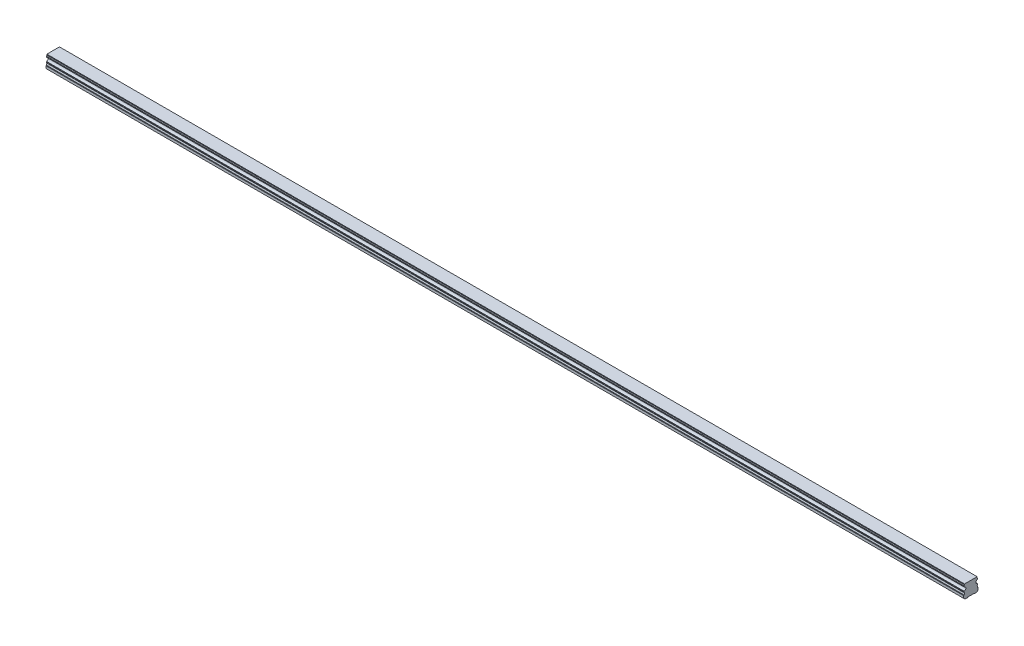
ISO-10303-21;
HEADER;
FILE_DESCRIPTION(('STEP AP214'),'2;1');
FILE_NAME('part.step','',(''),(''),'','','');
FILE_SCHEMA(('AUTOMOTIVE_DESIGN { 1 0 10303 214 1 1 1 1 }'));
ENDSEC;
DATA;
#1=APPLICATION_CONTEXT('core data for automotive mechanical design processes');
#2=APPLICATION_PROTOCOL_DEFINITION('international standard','automotive_design',2000,#1);
#3=PRODUCT_CONTEXT('',#1,'mechanical');
#4=PRODUCT('Part','Part','',(#3));
#5=PRODUCT_RELATED_PRODUCT_CATEGORY('part','',(#4));
#6=PRODUCT_DEFINITION_FORMATION('','',#4);
#7=PRODUCT_DEFINITION_CONTEXT('part definition',#1,'design');
#8=PRODUCT_DEFINITION('design','',#6,#7);
#9=PRODUCT_DEFINITION_SHAPE('','',#8);
#10=(LENGTH_UNIT() NAMED_UNIT(*) SI_UNIT(.MILLI.,.METRE.));
#11=(NAMED_UNIT(*) PLANE_ANGLE_UNIT() SI_UNIT($,.RADIAN.));
#12=(NAMED_UNIT(*) SI_UNIT($,.STERADIAN.) SOLID_ANGLE_UNIT());
#13=UNCERTAINTY_MEASURE_WITH_UNIT(LENGTH_MEASURE(1.E-05),#10,'distance_accuracy_value','');
#14=(GEOMETRIC_REPRESENTATION_CONTEXT(3) GLOBAL_UNCERTAINTY_ASSIGNED_CONTEXT((#13)) GLOBAL_UNIT_ASSIGNED_CONTEXT((#10,
#11,#12)) REPRESENTATION_CONTEXT('',''));
#15=CARTESIAN_POINT('',(0.,0.,0.));
#16=DIRECTION('',(0.,0.,1.));
#17=DIRECTION('',(1.,0.,0.));
#18=AXIS2_PLACEMENT_3D('',#15,#16,#17);
#19=CARTESIAN_POINT('',(930.,0.399999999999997,0.));
#20=DIRECTION('',(0.,-1.,0.));
#21=DIRECTION('',(0.,0.,-1.));
#22=AXIS2_PLACEMENT_3D('',#19,#20,#21);
#23=CONICAL_SURFACE('',#22,2.90000000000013,0.785398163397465);
#24=CARTESIAN_POINT('',(930.,0.800000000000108,0.));
#25=DIRECTION('',(0.,1.,0.));
#26=DIRECTION('',(0.,0.,1.));
#27=AXIS2_PLACEMENT_3D('',#24,#25,#26);
#28=CIRCLE('',#27,2.5);
#29=CARTESIAN_POINT('',(930.,0.80000000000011,2.5));
#30=VERTEX_POINT('',#29);
#31=EDGE_CURVE('E11',#30,#30,#28,.F.);
#32=ORIENTED_EDGE('',*,*,#31,.F.);
#33=EDGE_LOOP('',(#32));
#34=FACE_BOUND('',#33,.T.);
#35=CARTESIAN_POINT('',(930.,0.399999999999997,0.));
#36=DIRECTION('',(0.,1.,0.));
#37=DIRECTION('',(0.,0.,1.));
#38=AXIS2_PLACEMENT_3D('',#35,#36,#37);
#39=CIRCLE('',#38,2.90000000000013);
#40=CARTESIAN_POINT('',(930.,0.399999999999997,2.90000000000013));
#41=VERTEX_POINT('',#40);
#42=EDGE_CURVE('E589',#41,#41,#39,.T.);
#43=ORIENTED_EDGE('',*,*,#42,.F.);
#44=EDGE_LOOP('',(#43));
#45=FACE_BOUND('',#44,.T.);
#46=ADVANCED_FACE('F39',(#34,#45),#23,.F.);
#47=CARTESIAN_POINT('',(930.,7.,0.));
#48=DIRECTION('',(0.,-1.,0.));
#49=DIRECTION('',(0.,0.,-1.));
#50=AXIS2_PLACEMENT_3D('',#47,#48,#49);
#51=CYLINDRICAL_SURFACE('',#50,2.5);
#52=ORIENTED_EDGE('',*,*,#31,.T.);
#53=EDGE_LOOP('',(#52));
#54=FACE_BOUND('',#53,.T.);
#55=CARTESIAN_POINT('',(930.,7.,0.));
#56=DIRECTION('',(0.,-1.,0.));
#57=DIRECTION('',(0.,0.,-1.));
#58=AXIS2_PLACEMENT_3D('',#55,#56,#57);
#59=CIRCLE('',#58,2.5);
#60=CARTESIAN_POINT('',(930.,7.,-2.50000000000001));
#61=VERTEX_POINT('',#60);
#62=EDGE_CURVE('E49',#61,#61,#59,.T.);
#63=ORIENTED_EDGE('',*,*,#62,.F.);
#64=EDGE_LOOP('',(#63));
#65=FACE_BOUND('',#64,.T.);
#66=ADVANCED_FACE('F821',(#54,#65),#51,.F.);
#67=CARTESIAN_POINT('',(930.,7.,0.));
#68=DIRECTION('',(0.,-1.,0.));
#69=DIRECTION('',(0.,0.,-1.));
#70=AXIS2_PLACEMENT_3D('',#67,#68,#69);
#71=PLANE('',#70);
#72=CARTESIAN_POINT('',(930.,7.,0.));
#73=DIRECTION('',(0.,-1.,0.));
#74=DIRECTION('',(0.,0.,-1.));
#75=AXIS2_PLACEMENT_3D('',#72,#73,#74);
#76=CIRCLE('',#75,2.1);
#77=CARTESIAN_POINT('',(930.,7.,-2.1));
#78=VERTEX_POINT('',#77);
#79=EDGE_CURVE('E42',#78,#78,#76,.T.);
#80=ORIENTED_EDGE('',*,*,#79,.F.);
#81=EDGE_LOOP('',(#80));
#82=FACE_BOUND('',#81,.T.);
#83=ORIENTED_EDGE('',*,*,#62,.T.);
#84=EDGE_LOOP('',(#83));
#85=FACE_BOUND('',#84,.T.);
#86=ADVANCED_FACE('F826',(#82,#85),#71,.T.);
#87=CARTESIAN_POINT('',(870.,0.399999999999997,0.));
#88=DIRECTION('',(0.,-1.,0.));
#89=DIRECTION('',(0.,0.,-1.));
#90=AXIS2_PLACEMENT_3D('',#87,#88,#89);
#91=CONICAL_SURFACE('',#90,2.90000000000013,0.785398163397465);
#92=CARTESIAN_POINT('',(870.,0.800000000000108,0.));
#93=DIRECTION('',(0.,1.,0.));
#94=DIRECTION('',(0.,0.,1.));
#95=AXIS2_PLACEMENT_3D('',#92,#93,#94);
#96=CIRCLE('',#95,2.5);
#97=CARTESIAN_POINT('',(870.,0.80000000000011,2.5));
#98=VERTEX_POINT('',#97);
#99=EDGE_CURVE('E585',#98,#98,#96,.F.);
#100=ORIENTED_EDGE('',*,*,#99,.F.);
#101=EDGE_LOOP('',(#100));
#102=FACE_BOUND('',#101,.T.);
#103=CARTESIAN_POINT('',(870.,0.399999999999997,0.));
#104=DIRECTION('',(0.,1.,0.));
#105=DIRECTION('',(0.,0.,1.));
#106=AXIS2_PLACEMENT_3D('',#103,#104,#105);
#107=CIRCLE('',#106,2.90000000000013);
#108=CARTESIAN_POINT('',(870.,0.399999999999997,2.90000000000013));
#109=VERTEX_POINT('',#108);
#110=EDGE_CURVE('E577',#109,#109,#107,.T.);
#111=ORIENTED_EDGE('',*,*,#110,.F.);
#112=EDGE_LOOP('',(#111));
#113=FACE_BOUND('',#112,.T.);
#114=ADVANCED_FACE('F1057',(#102,#113),#91,.F.);
#115=CARTESIAN_POINT('',(870.,7.,0.));
#116=DIRECTION('',(0.,-1.,0.));
#117=DIRECTION('',(0.,0.,-1.));
#118=AXIS2_PLACEMENT_3D('',#115,#116,#117);
#119=CYLINDRICAL_SURFACE('',#118,2.5);
#120=ORIENTED_EDGE('',*,*,#99,.T.);
#121=EDGE_LOOP('',(#120));
#122=FACE_BOUND('',#121,.T.);
#123=CARTESIAN_POINT('',(870.,7.,0.));
#124=DIRECTION('',(0.,-1.,0.));
#125=DIRECTION('',(0.,0.,-1.));
#126=AXIS2_PLACEMENT_3D('',#123,#124,#125);
#127=CIRCLE('',#126,2.5);
#128=CARTESIAN_POINT('',(870.,7.,-2.50000000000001));
#129=VERTEX_POINT('',#128);
#130=EDGE_CURVE('E581',#129,#129,#127,.T.);
#131=ORIENTED_EDGE('',*,*,#130,.F.);
#132=EDGE_LOOP('',(#131));
#133=FACE_BOUND('',#132,.T.);
#134=ADVANCED_FACE('F1053',(#122,#133),#119,.F.);
#135=CARTESIAN_POINT('',(870.,7.,0.));
#136=DIRECTION('',(0.,-1.,0.));
#137=DIRECTION('',(0.,0.,-1.));
#138=AXIS2_PLACEMENT_3D('',#135,#136,#137);
#139=PLANE('',#138);
#140=CARTESIAN_POINT('',(870.,7.,0.));
#141=DIRECTION('',(0.,-1.,0.));
#142=DIRECTION('',(0.,0.,-1.));
#143=AXIS2_PLACEMENT_3D('',#140,#141,#142);
#144=CIRCLE('',#143,2.1);
#145=CARTESIAN_POINT('',(870.,7.,-2.1));
#146=VERTEX_POINT('',#145);
#147=EDGE_CURVE('E648',#146,#146,#144,.T.);
#148=ORIENTED_EDGE('',*,*,#147,.F.);
#149=EDGE_LOOP('',(#148));
#150=FACE_BOUND('',#149,.T.);
#151=ORIENTED_EDGE('',*,*,#130,.T.);
#152=EDGE_LOOP('',(#151));
#153=FACE_BOUND('',#152,.T.);
#154=ADVANCED_FACE('F1049',(#150,#153),#139,.T.);
#155=CARTESIAN_POINT('',(810.,0.399999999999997,0.));
#156=DIRECTION('',(0.,-1.,0.));
#157=DIRECTION('',(0.,0.,-1.));
#158=AXIS2_PLACEMENT_3D('',#155,#156,#157);
#159=CONICAL_SURFACE('',#158,2.90000000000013,0.785398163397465);
#160=CARTESIAN_POINT('',(810.,0.800000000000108,0.));
#161=DIRECTION('',(0.,1.,0.));
#162=DIRECTION('',(0.,0.,1.));
#163=AXIS2_PLACEMENT_3D('',#160,#161,#162);
#164=CIRCLE('',#163,2.5);
#165=CARTESIAN_POINT('',(810.,0.80000000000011,2.5));
#166=VERTEX_POINT('',#165);
#167=EDGE_CURVE('E573',#166,#166,#164,.F.);
#168=ORIENTED_EDGE('',*,*,#167,.F.);
#169=EDGE_LOOP('',(#168));
#170=FACE_BOUND('',#169,.T.);
#171=CARTESIAN_POINT('',(810.,0.399999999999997,0.));
#172=DIRECTION('',(0.,1.,0.));
#173=DIRECTION('',(0.,0.,1.));
#174=AXIS2_PLACEMENT_3D('',#171,#172,#173);
#175=CIRCLE('',#174,2.90000000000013);
#176=CARTESIAN_POINT('',(810.,0.399999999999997,2.90000000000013));
#177=VERTEX_POINT('',#176);
#178=EDGE_CURVE('E565',#177,#177,#175,.T.);
#179=ORIENTED_EDGE('',*,*,#178,.F.);
#180=EDGE_LOOP('',(#179));
#181=FACE_BOUND('',#180,.T.);
#182=ADVANCED_FACE('F1045',(#170,#181),#159,.F.);
#183=CARTESIAN_POINT('',(810.,7.,0.));
#184=DIRECTION('',(0.,-1.,0.));
#185=DIRECTION('',(0.,0.,-1.));
#186=AXIS2_PLACEMENT_3D('',#183,#184,#185);
#187=CYLINDRICAL_SURFACE('',#186,2.5);
#188=ORIENTED_EDGE('',*,*,#167,.T.);
#189=EDGE_LOOP('',(#188));
#190=FACE_BOUND('',#189,.T.);
#191=CARTESIAN_POINT('',(810.,7.,0.));
#192=DIRECTION('',(0.,-1.,0.));
#193=DIRECTION('',(0.,0.,-1.));
#194=AXIS2_PLACEMENT_3D('',#191,#192,#193);
#195=CIRCLE('',#194,2.5);
#196=CARTESIAN_POINT('',(810.,7.,-2.50000000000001));
#197=VERTEX_POINT('',#196);
#198=EDGE_CURVE('E569',#197,#197,#195,.T.);
#199=ORIENTED_EDGE('',*,*,#198,.F.);
#200=EDGE_LOOP('',(#199));
#201=FACE_BOUND('',#200,.T.);
#202=ADVANCED_FACE('F1041',(#190,#201),#187,.F.);
#203=CARTESIAN_POINT('',(810.,7.,0.));
#204=DIRECTION('',(0.,-1.,0.));
#205=DIRECTION('',(0.,0.,-1.));
#206=AXIS2_PLACEMENT_3D('',#203,#204,#205);
#207=PLANE('',#206);
#208=CARTESIAN_POINT('',(810.,7.,0.));
#209=DIRECTION('',(0.,-1.,0.));
#210=DIRECTION('',(0.,0.,-1.));
#211=AXIS2_PLACEMENT_3D('',#208,#209,#210);
#212=CIRCLE('',#211,2.1);
#213=CARTESIAN_POINT('',(810.,7.,-2.1));
#214=VERTEX_POINT('',#213);
#215=EDGE_CURVE('E645',#214,#214,#212,.T.);
#216=ORIENTED_EDGE('',*,*,#215,.F.);
#217=EDGE_LOOP('',(#216));
#218=FACE_BOUND('',#217,.T.);
#219=ORIENTED_EDGE('',*,*,#198,.T.);
#220=EDGE_LOOP('',(#219));
#221=FACE_BOUND('',#220,.T.);
#222=ADVANCED_FACE('F1037',(#218,#221),#207,.T.);
#223=CARTESIAN_POINT('',(750.,0.399999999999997,0.));
#224=DIRECTION('',(0.,-1.,0.));
#225=DIRECTION('',(0.,0.,-1.));
#226=AXIS2_PLACEMENT_3D('',#223,#224,#225);
#227=CONICAL_SURFACE('',#226,2.90000000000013,0.785398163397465);
#228=CARTESIAN_POINT('',(750.,0.800000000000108,0.));
#229=DIRECTION('',(0.,1.,0.));
#230=DIRECTION('',(0.,0.,1.));
#231=AXIS2_PLACEMENT_3D('',#228,#229,#230);
#232=CIRCLE('',#231,2.5);
#233=CARTESIAN_POINT('',(750.,0.80000000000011,2.5));
#234=VERTEX_POINT('',#233);
#235=EDGE_CURVE('E561',#234,#234,#232,.F.);
#236=ORIENTED_EDGE('',*,*,#235,.F.);
#237=EDGE_LOOP('',(#236));
#238=FACE_BOUND('',#237,.T.);
#239=CARTESIAN_POINT('',(750.,0.399999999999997,0.));
#240=DIRECTION('',(0.,1.,0.));
#241=DIRECTION('',(0.,0.,1.));
#242=AXIS2_PLACEMENT_3D('',#239,#240,#241);
#243=CIRCLE('',#242,2.90000000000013);
#244=CARTESIAN_POINT('',(750.,0.399999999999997,2.90000000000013));
#245=VERTEX_POINT('',#244);
#246=EDGE_CURVE('E553',#245,#245,#243,.T.);
#247=ORIENTED_EDGE('',*,*,#246,.F.);
#248=EDGE_LOOP('',(#247));
#249=FACE_BOUND('',#248,.T.);
#250=ADVANCED_FACE('F1033',(#238,#249),#227,.F.);
#251=CARTESIAN_POINT('',(750.,7.,0.));
#252=DIRECTION('',(0.,-1.,0.));
#253=DIRECTION('',(0.,0.,-1.));
#254=AXIS2_PLACEMENT_3D('',#251,#252,#253);
#255=CYLINDRICAL_SURFACE('',#254,2.5);
#256=ORIENTED_EDGE('',*,*,#235,.T.);
#257=EDGE_LOOP('',(#256));
#258=FACE_BOUND('',#257,.T.);
#259=CARTESIAN_POINT('',(750.,7.,0.));
#260=DIRECTION('',(0.,-1.,0.));
#261=DIRECTION('',(0.,0.,-1.));
#262=AXIS2_PLACEMENT_3D('',#259,#260,#261);
#263=CIRCLE('',#262,2.5);
#264=CARTESIAN_POINT('',(750.,7.,-2.50000000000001));
#265=VERTEX_POINT('',#264);
#266=EDGE_CURVE('E557',#265,#265,#263,.T.);
#267=ORIENTED_EDGE('',*,*,#266,.F.);
#268=EDGE_LOOP('',(#267));
#269=FACE_BOUND('',#268,.T.);
#270=ADVANCED_FACE('F1029',(#258,#269),#255,.F.);
#271=CARTESIAN_POINT('',(750.,7.,0.));
#272=DIRECTION('',(0.,-1.,0.));
#273=DIRECTION('',(0.,0.,-1.));
#274=AXIS2_PLACEMENT_3D('',#271,#272,#273);
#275=PLANE('',#274);
#276=CARTESIAN_POINT('',(750.,7.,0.));
#277=DIRECTION('',(0.,-1.,0.));
#278=DIRECTION('',(0.,0.,-1.));
#279=AXIS2_PLACEMENT_3D('',#276,#277,#278);
#280=CIRCLE('',#279,2.1);
#281=CARTESIAN_POINT('',(750.,7.,-2.1));
#282=VERTEX_POINT('',#281);
#283=EDGE_CURVE('E641',#282,#282,#280,.T.);
#284=ORIENTED_EDGE('',*,*,#283,.F.);
#285=EDGE_LOOP('',(#284));
#286=FACE_BOUND('',#285,.T.);
#287=ORIENTED_EDGE('',*,*,#266,.T.);
#288=EDGE_LOOP('',(#287));
#289=FACE_BOUND('',#288,.T.);
#290=ADVANCED_FACE('F1025',(#286,#289),#275,.T.);
#291=CARTESIAN_POINT('',(690.,0.399999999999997,0.));
#292=DIRECTION('',(0.,-1.,0.));
#293=DIRECTION('',(0.,0.,-1.));
#294=AXIS2_PLACEMENT_3D('',#291,#292,#293);
#295=CONICAL_SURFACE('',#294,2.90000000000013,0.785398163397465);
#296=CARTESIAN_POINT('',(690.,0.800000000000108,0.));
#297=DIRECTION('',(0.,1.,0.));
#298=DIRECTION('',(0.,0.,1.));
#299=AXIS2_PLACEMENT_3D('',#296,#297,#298);
#300=CIRCLE('',#299,2.5);
#301=CARTESIAN_POINT('',(690.,0.80000000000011,2.5));
#302=VERTEX_POINT('',#301);
#303=EDGE_CURVE('E549',#302,#302,#300,.F.);
#304=ORIENTED_EDGE('',*,*,#303,.F.);
#305=EDGE_LOOP('',(#304));
#306=FACE_BOUND('',#305,.T.);
#307=CARTESIAN_POINT('',(690.,0.399999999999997,0.));
#308=DIRECTION('',(0.,1.,0.));
#309=DIRECTION('',(0.,0.,1.));
#310=AXIS2_PLACEMENT_3D('',#307,#308,#309);
#311=CIRCLE('',#310,2.90000000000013);
#312=CARTESIAN_POINT('',(690.,0.399999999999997,2.90000000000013));
#313=VERTEX_POINT('',#312);
#314=EDGE_CURVE('E541',#313,#313,#311,.T.);
#315=ORIENTED_EDGE('',*,*,#314,.F.);
#316=EDGE_LOOP('',(#315));
#317=FACE_BOUND('',#316,.T.);
#318=ADVANCED_FACE('F1021',(#306,#317),#295,.F.);
#319=CARTESIAN_POINT('',(690.,7.,0.));
#320=DIRECTION('',(0.,-1.,0.));
#321=DIRECTION('',(0.,0.,-1.));
#322=AXIS2_PLACEMENT_3D('',#319,#320,#321);
#323=CYLINDRICAL_SURFACE('',#322,2.5);
#324=ORIENTED_EDGE('',*,*,#303,.T.);
#325=EDGE_LOOP('',(#324));
#326=FACE_BOUND('',#325,.T.);
#327=CARTESIAN_POINT('',(690.,7.,0.));
#328=DIRECTION('',(0.,-1.,0.));
#329=DIRECTION('',(0.,0.,-1.));
#330=AXIS2_PLACEMENT_3D('',#327,#328,#329);
#331=CIRCLE('',#330,2.5);
#332=CARTESIAN_POINT('',(690.,7.,-2.50000000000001));
#333=VERTEX_POINT('',#332);
#334=EDGE_CURVE('E545',#333,#333,#331,.T.);
#335=ORIENTED_EDGE('',*,*,#334,.F.);
#336=EDGE_LOOP('',(#335));
#337=FACE_BOUND('',#336,.T.);
#338=ADVANCED_FACE('F1017',(#326,#337),#323,.F.);
#339=CARTESIAN_POINT('',(690.,7.,0.));
#340=DIRECTION('',(0.,-1.,0.));
#341=DIRECTION('',(0.,0.,-1.));
#342=AXIS2_PLACEMENT_3D('',#339,#340,#341);
#343=PLANE('',#342);
#344=CARTESIAN_POINT('',(690.,7.,0.));
#345=DIRECTION('',(0.,-1.,0.));
#346=DIRECTION('',(0.,0.,-1.));
#347=AXIS2_PLACEMENT_3D('',#344,#345,#346);
#348=CIRCLE('',#347,2.1);
#349=CARTESIAN_POINT('',(690.,7.,-2.1));
#350=VERTEX_POINT('',#349);
#351=EDGE_CURVE('E637',#350,#350,#348,.T.);
#352=ORIENTED_EDGE('',*,*,#351,.F.);
#353=EDGE_LOOP('',(#352));
#354=FACE_BOUND('',#353,.T.);
#355=ORIENTED_EDGE('',*,*,#334,.T.);
#356=EDGE_LOOP('',(#355));
#357=FACE_BOUND('',#356,.T.);
#358=ADVANCED_FACE('F1013',(#354,#357),#343,.T.);
#359=CARTESIAN_POINT('',(630.,0.399999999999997,0.));
#360=DIRECTION('',(0.,-1.,0.));
#361=DIRECTION('',(0.,0.,-1.));
#362=AXIS2_PLACEMENT_3D('',#359,#360,#361);
#363=CONICAL_SURFACE('',#362,2.90000000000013,0.785398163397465);
#364=CARTESIAN_POINT('',(630.,0.800000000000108,0.));
#365=DIRECTION('',(0.,1.,0.));
#366=DIRECTION('',(0.,0.,1.));
#367=AXIS2_PLACEMENT_3D('',#364,#365,#366);
#368=CIRCLE('',#367,2.5);
#369=CARTESIAN_POINT('',(630.,0.80000000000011,2.5));
#370=VERTEX_POINT('',#369);
#371=EDGE_CURVE('E537',#370,#370,#368,.F.);
#372=ORIENTED_EDGE('',*,*,#371,.F.);
#373=EDGE_LOOP('',(#372));
#374=FACE_BOUND('',#373,.T.);
#375=CARTESIAN_POINT('',(630.,0.399999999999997,0.));
#376=DIRECTION('',(0.,1.,0.));
#377=DIRECTION('',(0.,0.,1.));
#378=AXIS2_PLACEMENT_3D('',#375,#376,#377);
#379=CIRCLE('',#378,2.90000000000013);
#380=CARTESIAN_POINT('',(630.,0.399999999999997,2.90000000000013));
#381=VERTEX_POINT('',#380);
#382=EDGE_CURVE('E529',#381,#381,#379,.T.);
#383=ORIENTED_EDGE('',*,*,#382,.F.);
#384=EDGE_LOOP('',(#383));
#385=FACE_BOUND('',#384,.T.);
#386=ADVANCED_FACE('F1009',(#374,#385),#363,.F.);
#387=CARTESIAN_POINT('',(630.,7.,0.));
#388=DIRECTION('',(0.,-1.,0.));
#389=DIRECTION('',(0.,0.,-1.));
#390=AXIS2_PLACEMENT_3D('',#387,#388,#389);
#391=CYLINDRICAL_SURFACE('',#390,2.5);
#392=ORIENTED_EDGE('',*,*,#371,.T.);
#393=EDGE_LOOP('',(#392));
#394=FACE_BOUND('',#393,.T.);
#395=CARTESIAN_POINT('',(630.,7.,0.));
#396=DIRECTION('',(0.,-1.,0.));
#397=DIRECTION('',(0.,0.,-1.));
#398=AXIS2_PLACEMENT_3D('',#395,#396,#397);
#399=CIRCLE('',#398,2.5);
#400=CARTESIAN_POINT('',(630.,7.,-2.50000000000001));
#401=VERTEX_POINT('',#400);
#402=EDGE_CURVE('E533',#401,#401,#399,.T.);
#403=ORIENTED_EDGE('',*,*,#402,.F.);
#404=EDGE_LOOP('',(#403));
#405=FACE_BOUND('',#404,.T.);
#406=ADVANCED_FACE('F1005',(#394,#405),#391,.F.);
#407=CARTESIAN_POINT('',(630.,7.,0.));
#408=DIRECTION('',(0.,-1.,0.));
#409=DIRECTION('',(0.,0.,-1.));
#410=AXIS2_PLACEMENT_3D('',#407,#408,#409);
#411=PLANE('',#410);
#412=CARTESIAN_POINT('',(630.,7.,0.));
#413=DIRECTION('',(0.,-1.,0.));
#414=DIRECTION('',(0.,0.,-1.));
#415=AXIS2_PLACEMENT_3D('',#412,#413,#414);
#416=CIRCLE('',#415,2.1);
#417=CARTESIAN_POINT('',(630.,7.,-2.1));
#418=VERTEX_POINT('',#417);
#419=EDGE_CURVE('E633',#418,#418,#416,.T.);
#420=ORIENTED_EDGE('',*,*,#419,.F.);
#421=EDGE_LOOP('',(#420));
#422=FACE_BOUND('',#421,.T.);
#423=ORIENTED_EDGE('',*,*,#402,.T.);
#424=EDGE_LOOP('',(#423));
#425=FACE_BOUND('',#424,.T.);
#426=ADVANCED_FACE('F1001',(#422,#425),#411,.T.);
#427=CARTESIAN_POINT('',(570.,0.399999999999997,0.));
#428=DIRECTION('',(0.,-1.,0.));
#429=DIRECTION('',(0.,0.,-1.));
#430=AXIS2_PLACEMENT_3D('',#427,#428,#429);
#431=CONICAL_SURFACE('',#430,2.90000000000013,0.785398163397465);
#432=CARTESIAN_POINT('',(570.,0.800000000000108,0.));
#433=DIRECTION('',(0.,1.,0.));
#434=DIRECTION('',(0.,0.,1.));
#435=AXIS2_PLACEMENT_3D('',#432,#433,#434);
#436=CIRCLE('',#435,2.5);
#437=CARTESIAN_POINT('',(570.,0.80000000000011,2.5));
#438=VERTEX_POINT('',#437);
#439=EDGE_CURVE('E525',#438,#438,#436,.F.);
#440=ORIENTED_EDGE('',*,*,#439,.F.);
#441=EDGE_LOOP('',(#440));
#442=FACE_BOUND('',#441,.T.);
#443=CARTESIAN_POINT('',(570.,0.399999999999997,0.));
#444=DIRECTION('',(0.,1.,0.));
#445=DIRECTION('',(0.,0.,1.));
#446=AXIS2_PLACEMENT_3D('',#443,#444,#445);
#447=CIRCLE('',#446,2.90000000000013);
#448=CARTESIAN_POINT('',(570.,0.399999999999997,2.90000000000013));
#449=VERTEX_POINT('',#448);
#450=EDGE_CURVE('E517',#449,#449,#447,.T.);
#451=ORIENTED_EDGE('',*,*,#450,.F.);
#452=EDGE_LOOP('',(#451));
#453=FACE_BOUND('',#452,.T.);
#454=ADVANCED_FACE('F997',(#442,#453),#431,.F.);
#455=CARTESIAN_POINT('',(570.,7.,0.));
#456=DIRECTION('',(0.,-1.,0.));
#457=DIRECTION('',(0.,0.,-1.));
#458=AXIS2_PLACEMENT_3D('',#455,#456,#457);
#459=CYLINDRICAL_SURFACE('',#458,2.5);
#460=ORIENTED_EDGE('',*,*,#439,.T.);
#461=EDGE_LOOP('',(#460));
#462=FACE_BOUND('',#461,.T.);
#463=CARTESIAN_POINT('',(570.,7.,0.));
#464=DIRECTION('',(0.,-1.,0.));
#465=DIRECTION('',(0.,0.,-1.));
#466=AXIS2_PLACEMENT_3D('',#463,#464,#465);
#467=CIRCLE('',#466,2.5);
#468=CARTESIAN_POINT('',(570.,7.,-2.50000000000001));
#469=VERTEX_POINT('',#468);
#470=EDGE_CURVE('E521',#469,#469,#467,.T.);
#471=ORIENTED_EDGE('',*,*,#470,.F.);
#472=EDGE_LOOP('',(#471));
#473=FACE_BOUND('',#472,.T.);
#474=ADVANCED_FACE('F993',(#462,#473),#459,.F.);
#475=CARTESIAN_POINT('',(570.,7.,0.));
#476=DIRECTION('',(0.,-1.,0.));
#477=DIRECTION('',(0.,0.,-1.));
#478=AXIS2_PLACEMENT_3D('',#475,#476,#477);
#479=PLANE('',#478);
#480=CARTESIAN_POINT('',(570.,7.,0.));
#481=DIRECTION('',(0.,-1.,0.));
#482=DIRECTION('',(0.,0.,-1.));
#483=AXIS2_PLACEMENT_3D('',#480,#481,#482);
#484=CIRCLE('',#483,2.1);
#485=CARTESIAN_POINT('',(570.,7.,-2.1));
#486=VERTEX_POINT('',#485);
#487=EDGE_CURVE('E629',#486,#486,#484,.T.);
#488=ORIENTED_EDGE('',*,*,#487,.F.);
#489=EDGE_LOOP('',(#488));
#490=FACE_BOUND('',#489,.T.);
#491=ORIENTED_EDGE('',*,*,#470,.T.);
#492=EDGE_LOOP('',(#491));
#493=FACE_BOUND('',#492,.T.);
#494=ADVANCED_FACE('F989',(#490,#493),#479,.T.);
#495=CARTESIAN_POINT('',(510.,0.399999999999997,0.));
#496=DIRECTION('',(0.,-1.,0.));
#497=DIRECTION('',(0.,0.,-1.));
#498=AXIS2_PLACEMENT_3D('',#495,#496,#497);
#499=CONICAL_SURFACE('',#498,2.90000000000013,0.785398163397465);
#500=CARTESIAN_POINT('',(510.,0.800000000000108,0.));
#501=DIRECTION('',(0.,1.,0.));
#502=DIRECTION('',(0.,0.,1.));
#503=AXIS2_PLACEMENT_3D('',#500,#501,#502);
#504=CIRCLE('',#503,2.5);
#505=CARTESIAN_POINT('',(510.,0.80000000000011,2.5));
#506=VERTEX_POINT('',#505);
#507=EDGE_CURVE('E513',#506,#506,#504,.F.);
#508=ORIENTED_EDGE('',*,*,#507,.F.);
#509=EDGE_LOOP('',(#508));
#510=FACE_BOUND('',#509,.T.);
#511=CARTESIAN_POINT('',(510.,0.399999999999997,0.));
#512=DIRECTION('',(0.,1.,0.));
#513=DIRECTION('',(0.,0.,1.));
#514=AXIS2_PLACEMENT_3D('',#511,#512,#513);
#515=CIRCLE('',#514,2.90000000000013);
#516=CARTESIAN_POINT('',(510.,0.399999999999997,2.90000000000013));
#517=VERTEX_POINT('',#516);
#518=EDGE_CURVE('E505',#517,#517,#515,.T.);
#519=ORIENTED_EDGE('',*,*,#518,.F.);
#520=EDGE_LOOP('',(#519));
#521=FACE_BOUND('',#520,.T.);
#522=ADVANCED_FACE('F985',(#510,#521),#499,.F.);
#523=CARTESIAN_POINT('',(510.,7.,0.));
#524=DIRECTION('',(0.,-1.,0.));
#525=DIRECTION('',(0.,0.,-1.));
#526=AXIS2_PLACEMENT_3D('',#523,#524,#525);
#527=CYLINDRICAL_SURFACE('',#526,2.5);
#528=ORIENTED_EDGE('',*,*,#507,.T.);
#529=EDGE_LOOP('',(#528));
#530=FACE_BOUND('',#529,.T.);
#531=CARTESIAN_POINT('',(510.,7.,0.));
#532=DIRECTION('',(0.,-1.,0.));
#533=DIRECTION('',(0.,0.,-1.));
#534=AXIS2_PLACEMENT_3D('',#531,#532,#533);
#535=CIRCLE('',#534,2.5);
#536=CARTESIAN_POINT('',(510.,7.,-2.50000000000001));
#537=VERTEX_POINT('',#536);
#538=EDGE_CURVE('E509',#537,#537,#535,.T.);
#539=ORIENTED_EDGE('',*,*,#538,.F.);
#540=EDGE_LOOP('',(#539));
#541=FACE_BOUND('',#540,.T.);
#542=ADVANCED_FACE('F981',(#530,#541),#527,.F.);
#543=CARTESIAN_POINT('',(510.,7.,0.));
#544=DIRECTION('',(0.,-1.,0.));
#545=DIRECTION('',(0.,0.,-1.));
#546=AXIS2_PLACEMENT_3D('',#543,#544,#545);
#547=PLANE('',#546);
#548=CARTESIAN_POINT('',(510.,7.,0.));
#549=DIRECTION('',(0.,-1.,0.));
#550=DIRECTION('',(0.,0.,-1.));
#551=AXIS2_PLACEMENT_3D('',#548,#549,#550);
#552=CIRCLE('',#551,2.1);
#553=CARTESIAN_POINT('',(510.,7.,-2.1));
#554=VERTEX_POINT('',#553);
#555=EDGE_CURVE('E625',#554,#554,#552,.T.);
#556=ORIENTED_EDGE('',*,*,#555,.F.);
#557=EDGE_LOOP('',(#556));
#558=FACE_BOUND('',#557,.T.);
#559=ORIENTED_EDGE('',*,*,#538,.T.);
#560=EDGE_LOOP('',(#559));
#561=FACE_BOUND('',#560,.T.);
#562=ADVANCED_FACE('F977',(#558,#561),#547,.T.);
#563=CARTESIAN_POINT('',(450.,0.399999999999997,0.));
#564=DIRECTION('',(0.,-1.,0.));
#565=DIRECTION('',(0.,0.,-1.));
#566=AXIS2_PLACEMENT_3D('',#563,#564,#565);
#567=CONICAL_SURFACE('',#566,2.90000000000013,0.785398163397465);
#568=CARTESIAN_POINT('',(450.,0.800000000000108,0.));
#569=DIRECTION('',(0.,1.,0.));
#570=DIRECTION('',(0.,0.,1.));
#571=AXIS2_PLACEMENT_3D('',#568,#569,#570);
#572=CIRCLE('',#571,2.5);
#573=CARTESIAN_POINT('',(450.,0.80000000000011,2.5));
#574=VERTEX_POINT('',#573);
#575=EDGE_CURVE('E501',#574,#574,#572,.F.);
#576=ORIENTED_EDGE('',*,*,#575,.F.);
#577=EDGE_LOOP('',(#576));
#578=FACE_BOUND('',#577,.T.);
#579=CARTESIAN_POINT('',(450.,0.399999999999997,0.));
#580=DIRECTION('',(0.,1.,0.));
#581=DIRECTION('',(0.,0.,1.));
#582=AXIS2_PLACEMENT_3D('',#579,#580,#581);
#583=CIRCLE('',#582,2.90000000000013);
#584=CARTESIAN_POINT('',(450.,0.399999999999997,2.90000000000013));
#585=VERTEX_POINT('',#584);
#586=EDGE_CURVE('E493',#585,#585,#583,.T.);
#587=ORIENTED_EDGE('',*,*,#586,.F.);
#588=EDGE_LOOP('',(#587));
#589=FACE_BOUND('',#588,.T.);
#590=ADVANCED_FACE('F973',(#578,#589),#567,.F.);
#591=CARTESIAN_POINT('',(450.,7.,0.));
#592=DIRECTION('',(0.,-1.,0.));
#593=DIRECTION('',(0.,0.,-1.));
#594=AXIS2_PLACEMENT_3D('',#591,#592,#593);
#595=CYLINDRICAL_SURFACE('',#594,2.5);
#596=ORIENTED_EDGE('',*,*,#575,.T.);
#597=EDGE_LOOP('',(#596));
#598=FACE_BOUND('',#597,.T.);
#599=CARTESIAN_POINT('',(450.,7.,0.));
#600=DIRECTION('',(0.,-1.,0.));
#601=DIRECTION('',(0.,0.,-1.));
#602=AXIS2_PLACEMENT_3D('',#599,#600,#601);
#603=CIRCLE('',#602,2.5);
#604=CARTESIAN_POINT('',(450.,7.,-2.50000000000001));
#605=VERTEX_POINT('',#604);
#606=EDGE_CURVE('E497',#605,#605,#603,.T.);
#607=ORIENTED_EDGE('',*,*,#606,.F.);
#608=EDGE_LOOP('',(#607));
#609=FACE_BOUND('',#608,.T.);
#610=ADVANCED_FACE('F969',(#598,#609),#595,.F.);
#611=CARTESIAN_POINT('',(450.,7.,0.));
#612=DIRECTION('',(0.,-1.,0.));
#613=DIRECTION('',(0.,0.,-1.));
#614=AXIS2_PLACEMENT_3D('',#611,#612,#613);
#615=PLANE('',#614);
#616=CARTESIAN_POINT('',(450.,7.,0.));
#617=DIRECTION('',(0.,-1.,0.));
#618=DIRECTION('',(0.,0.,-1.));
#619=AXIS2_PLACEMENT_3D('',#616,#617,#618);
#620=CIRCLE('',#619,2.1);
#621=CARTESIAN_POINT('',(450.,7.,-2.1));
#622=VERTEX_POINT('',#621);
#623=EDGE_CURVE('E621',#622,#622,#620,.T.);
#624=ORIENTED_EDGE('',*,*,#623,.F.);
#625=EDGE_LOOP('',(#624));
#626=FACE_BOUND('',#625,.T.);
#627=ORIENTED_EDGE('',*,*,#606,.T.);
#628=EDGE_LOOP('',(#627));
#629=FACE_BOUND('',#628,.T.);
#630=ADVANCED_FACE('F965',(#626,#629),#615,.T.);
#631=CARTESIAN_POINT('',(390.,0.399999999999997,0.));
#632=DIRECTION('',(0.,-1.,0.));
#633=DIRECTION('',(0.,0.,-1.));
#634=AXIS2_PLACEMENT_3D('',#631,#632,#633);
#635=CONICAL_SURFACE('',#634,2.90000000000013,0.785398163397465);
#636=CARTESIAN_POINT('',(390.,0.800000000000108,0.));
#637=DIRECTION('',(0.,1.,0.));
#638=DIRECTION('',(0.,0.,1.));
#639=AXIS2_PLACEMENT_3D('',#636,#637,#638);
#640=CIRCLE('',#639,2.5);
#641=CARTESIAN_POINT('',(390.,0.80000000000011,2.5));
#642=VERTEX_POINT('',#641);
#643=EDGE_CURVE('E489',#642,#642,#640,.F.);
#644=ORIENTED_EDGE('',*,*,#643,.F.);
#645=EDGE_LOOP('',(#644));
#646=FACE_BOUND('',#645,.T.);
#647=CARTESIAN_POINT('',(390.,0.399999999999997,0.));
#648=DIRECTION('',(0.,1.,0.));
#649=DIRECTION('',(0.,0.,1.));
#650=AXIS2_PLACEMENT_3D('',#647,#648,#649);
#651=CIRCLE('',#650,2.90000000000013);
#652=CARTESIAN_POINT('',(390.,0.399999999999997,2.90000000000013));
#653=VERTEX_POINT('',#652);
#654=EDGE_CURVE('E481',#653,#653,#651,.T.);
#655=ORIENTED_EDGE('',*,*,#654,.F.);
#656=EDGE_LOOP('',(#655));
#657=FACE_BOUND('',#656,.T.);
#658=ADVANCED_FACE('F961',(#646,#657),#635,.F.);
#659=CARTESIAN_POINT('',(390.,7.,0.));
#660=DIRECTION('',(0.,-1.,0.));
#661=DIRECTION('',(0.,0.,-1.));
#662=AXIS2_PLACEMENT_3D('',#659,#660,#661);
#663=CYLINDRICAL_SURFACE('',#662,2.5);
#664=ORIENTED_EDGE('',*,*,#643,.T.);
#665=EDGE_LOOP('',(#664));
#666=FACE_BOUND('',#665,.T.);
#667=CARTESIAN_POINT('',(390.,7.,0.));
#668=DIRECTION('',(0.,-1.,0.));
#669=DIRECTION('',(0.,0.,-1.));
#670=AXIS2_PLACEMENT_3D('',#667,#668,#669);
#671=CIRCLE('',#670,2.5);
#672=CARTESIAN_POINT('',(390.,7.,-2.50000000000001));
#673=VERTEX_POINT('',#672);
#674=EDGE_CURVE('E485',#673,#673,#671,.T.);
#675=ORIENTED_EDGE('',*,*,#674,.F.);
#676=EDGE_LOOP('',(#675));
#677=FACE_BOUND('',#676,.T.);
#678=ADVANCED_FACE('F957',(#666,#677),#663,.F.);
#679=CARTESIAN_POINT('',(390.,7.,0.));
#680=DIRECTION('',(0.,-1.,0.));
#681=DIRECTION('',(0.,0.,-1.));
#682=AXIS2_PLACEMENT_3D('',#679,#680,#681);
#683=PLANE('',#682);
#684=CARTESIAN_POINT('',(390.,7.,0.));
#685=DIRECTION('',(0.,-1.,0.));
#686=DIRECTION('',(0.,0.,-1.));
#687=AXIS2_PLACEMENT_3D('',#684,#685,#686);
#688=CIRCLE('',#687,2.1);
#689=CARTESIAN_POINT('',(390.,7.,-2.1));
#690=VERTEX_POINT('',#689);
#691=EDGE_CURVE('E617',#690,#690,#688,.T.);
#692=ORIENTED_EDGE('',*,*,#691,.F.);
#693=EDGE_LOOP('',(#692));
#694=FACE_BOUND('',#693,.T.);
#695=ORIENTED_EDGE('',*,*,#674,.T.);
#696=EDGE_LOOP('',(#695));
#697=FACE_BOUND('',#696,.T.);
#698=ADVANCED_FACE('F953',(#694,#697),#683,.T.);
#699=CARTESIAN_POINT('',(330.,0.399999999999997,0.));
#700=DIRECTION('',(0.,-1.,0.));
#701=DIRECTION('',(0.,0.,-1.));
#702=AXIS2_PLACEMENT_3D('',#699,#700,#701);
#703=CONICAL_SURFACE('',#702,2.90000000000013,0.785398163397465);
#704=CARTESIAN_POINT('',(330.,0.800000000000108,0.));
#705=DIRECTION('',(0.,1.,0.));
#706=DIRECTION('',(0.,0.,1.));
#707=AXIS2_PLACEMENT_3D('',#704,#705,#706);
#708=CIRCLE('',#707,2.5);
#709=CARTESIAN_POINT('',(330.,0.80000000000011,2.5));
#710=VERTEX_POINT('',#709);
#711=EDGE_CURVE('E477',#710,#710,#708,.F.);
#712=ORIENTED_EDGE('',*,*,#711,.F.);
#713=EDGE_LOOP('',(#712));
#714=FACE_BOUND('',#713,.T.);
#715=CARTESIAN_POINT('',(330.,0.399999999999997,0.));
#716=DIRECTION('',(0.,1.,0.));
#717=DIRECTION('',(0.,0.,1.));
#718=AXIS2_PLACEMENT_3D('',#715,#716,#717);
#719=CIRCLE('',#718,2.90000000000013);
#720=CARTESIAN_POINT('',(330.,0.399999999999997,2.90000000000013));
#721=VERTEX_POINT('',#720);
#722=EDGE_CURVE('E469',#721,#721,#719,.T.);
#723=ORIENTED_EDGE('',*,*,#722,.F.);
#724=EDGE_LOOP('',(#723));
#725=FACE_BOUND('',#724,.T.);
#726=ADVANCED_FACE('F949',(#714,#725),#703,.F.);
#727=CARTESIAN_POINT('',(330.,7.,0.));
#728=DIRECTION('',(0.,-1.,0.));
#729=DIRECTION('',(0.,0.,-1.));
#730=AXIS2_PLACEMENT_3D('',#727,#728,#729);
#731=CYLINDRICAL_SURFACE('',#730,2.5);
#732=ORIENTED_EDGE('',*,*,#711,.T.);
#733=EDGE_LOOP('',(#732));
#734=FACE_BOUND('',#733,.T.);
#735=CARTESIAN_POINT('',(330.,7.,0.));
#736=DIRECTION('',(0.,-1.,0.));
#737=DIRECTION('',(0.,0.,-1.));
#738=AXIS2_PLACEMENT_3D('',#735,#736,#737);
#739=CIRCLE('',#738,2.5);
#740=CARTESIAN_POINT('',(330.,7.,-2.50000000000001));
#741=VERTEX_POINT('',#740);
#742=EDGE_CURVE('E473',#741,#741,#739,.T.);
#743=ORIENTED_EDGE('',*,*,#742,.F.);
#744=EDGE_LOOP('',(#743));
#745=FACE_BOUND('',#744,.T.);
#746=ADVANCED_FACE('F945',(#734,#745),#731,.F.);
#747=CARTESIAN_POINT('',(330.,7.,0.));
#748=DIRECTION('',(0.,-1.,0.));
#749=DIRECTION('',(0.,0.,-1.));
#750=AXIS2_PLACEMENT_3D('',#747,#748,#749);
#751=PLANE('',#750);
#752=CARTESIAN_POINT('',(330.,7.,0.));
#753=DIRECTION('',(0.,-1.,0.));
#754=DIRECTION('',(0.,0.,-1.));
#755=AXIS2_PLACEMENT_3D('',#752,#753,#754);
#756=CIRCLE('',#755,2.1);
#757=CARTESIAN_POINT('',(330.,7.,-2.1));
#758=VERTEX_POINT('',#757);
#759=EDGE_CURVE('E613',#758,#758,#756,.T.);
#760=ORIENTED_EDGE('',*,*,#759,.F.);
#761=EDGE_LOOP('',(#760));
#762=FACE_BOUND('',#761,.T.);
#763=ORIENTED_EDGE('',*,*,#742,.T.);
#764=EDGE_LOOP('',(#763));
#765=FACE_BOUND('',#764,.T.);
#766=ADVANCED_FACE('F941',(#762,#765),#751,.T.);
#767=CARTESIAN_POINT('',(270.,0.399999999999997,0.));
#768=DIRECTION('',(0.,-1.,0.));
#769=DIRECTION('',(0.,0.,-1.));
#770=AXIS2_PLACEMENT_3D('',#767,#768,#769);
#771=CONICAL_SURFACE('',#770,2.90000000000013,0.785398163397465);
#772=CARTESIAN_POINT('',(270.,0.800000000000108,0.));
#773=DIRECTION('',(0.,1.,0.));
#774=DIRECTION('',(0.,0.,1.));
#775=AXIS2_PLACEMENT_3D('',#772,#773,#774);
#776=CIRCLE('',#775,2.5);
#777=CARTESIAN_POINT('',(270.,0.80000000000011,2.5));
#778=VERTEX_POINT('',#777);
#779=EDGE_CURVE('E465',#778,#778,#776,.F.);
#780=ORIENTED_EDGE('',*,*,#779,.F.);
#781=EDGE_LOOP('',(#780));
#782=FACE_BOUND('',#781,.T.);
#783=CARTESIAN_POINT('',(270.,0.399999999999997,0.));
#784=DIRECTION('',(0.,1.,0.));
#785=DIRECTION('',(0.,0.,1.));
#786=AXIS2_PLACEMENT_3D('',#783,#784,#785);
#787=CIRCLE('',#786,2.90000000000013);
#788=CARTESIAN_POINT('',(270.,0.399999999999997,2.90000000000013));
#789=VERTEX_POINT('',#788);
#790=EDGE_CURVE('E457',#789,#789,#787,.T.);
#791=ORIENTED_EDGE('',*,*,#790,.F.);
#792=EDGE_LOOP('',(#791));
#793=FACE_BOUND('',#792,.T.);
#794=ADVANCED_FACE('F937',(#782,#793),#771,.F.);
#795=CARTESIAN_POINT('',(270.,7.,0.));
#796=DIRECTION('',(0.,-1.,0.));
#797=DIRECTION('',(0.,0.,-1.));
#798=AXIS2_PLACEMENT_3D('',#795,#796,#797);
#799=CYLINDRICAL_SURFACE('',#798,2.5);
#800=ORIENTED_EDGE('',*,*,#779,.T.);
#801=EDGE_LOOP('',(#800));
#802=FACE_BOUND('',#801,.T.);
#803=CARTESIAN_POINT('',(270.,7.,0.));
#804=DIRECTION('',(0.,-1.,0.));
#805=DIRECTION('',(0.,0.,-1.));
#806=AXIS2_PLACEMENT_3D('',#803,#804,#805);
#807=CIRCLE('',#806,2.5);
#808=CARTESIAN_POINT('',(270.,7.,-2.50000000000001));
#809=VERTEX_POINT('',#808);
#810=EDGE_CURVE('E461',#809,#809,#807,.T.);
#811=ORIENTED_EDGE('',*,*,#810,.F.);
#812=EDGE_LOOP('',(#811));
#813=FACE_BOUND('',#812,.T.);
#814=ADVANCED_FACE('F933',(#802,#813),#799,.F.);
#815=CARTESIAN_POINT('',(270.,7.,0.));
#816=DIRECTION('',(0.,-1.,0.));
#817=DIRECTION('',(0.,0.,-1.));
#818=AXIS2_PLACEMENT_3D('',#815,#816,#817);
#819=PLANE('',#818);
#820=CARTESIAN_POINT('',(270.,7.,0.));
#821=DIRECTION('',(0.,-1.,0.));
#822=DIRECTION('',(0.,0.,-1.));
#823=AXIS2_PLACEMENT_3D('',#820,#821,#822);
#824=CIRCLE('',#823,2.1);
#825=CARTESIAN_POINT('',(270.,7.,-2.1));
#826=VERTEX_POINT('',#825);
#827=EDGE_CURVE('E609',#826,#826,#824,.T.);
#828=ORIENTED_EDGE('',*,*,#827,.F.);
#829=EDGE_LOOP('',(#828));
#830=FACE_BOUND('',#829,.T.);
#831=ORIENTED_EDGE('',*,*,#810,.T.);
#832=EDGE_LOOP('',(#831));
#833=FACE_BOUND('',#832,.T.);
#834=ADVANCED_FACE('F929',(#830,#833),#819,.T.);
#835=CARTESIAN_POINT('',(210.,0.399999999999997,0.));
#836=DIRECTION('',(0.,-1.,0.));
#837=DIRECTION('',(0.,0.,-1.));
#838=AXIS2_PLACEMENT_3D('',#835,#836,#837);
#839=CONICAL_SURFACE('',#838,2.90000000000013,0.785398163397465);
#840=CARTESIAN_POINT('',(210.,0.800000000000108,0.));
#841=DIRECTION('',(0.,1.,0.));
#842=DIRECTION('',(0.,0.,1.));
#843=AXIS2_PLACEMENT_3D('',#840,#841,#842);
#844=CIRCLE('',#843,2.5);
#845=CARTESIAN_POINT('',(210.,0.80000000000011,2.5));
#846=VERTEX_POINT('',#845);
#847=EDGE_CURVE('E453',#846,#846,#844,.F.);
#848=ORIENTED_EDGE('',*,*,#847,.F.);
#849=EDGE_LOOP('',(#848));
#850=FACE_BOUND('',#849,.T.);
#851=CARTESIAN_POINT('',(210.,0.399999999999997,0.));
#852=DIRECTION('',(0.,1.,0.));
#853=DIRECTION('',(0.,0.,1.));
#854=AXIS2_PLACEMENT_3D('',#851,#852,#853);
#855=CIRCLE('',#854,2.90000000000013);
#856=CARTESIAN_POINT('',(210.,0.399999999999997,2.90000000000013));
#857=VERTEX_POINT('',#856);
#858=EDGE_CURVE('E445',#857,#857,#855,.T.);
#859=ORIENTED_EDGE('',*,*,#858,.F.);
#860=EDGE_LOOP('',(#859));
#861=FACE_BOUND('',#860,.T.);
#862=ADVANCED_FACE('F925',(#850,#861),#839,.F.);
#863=CARTESIAN_POINT('',(210.,7.,0.));
#864=DIRECTION('',(0.,-1.,0.));
#865=DIRECTION('',(0.,0.,-1.));
#866=AXIS2_PLACEMENT_3D('',#863,#864,#865);
#867=CYLINDRICAL_SURFACE('',#866,2.5);
#868=ORIENTED_EDGE('',*,*,#847,.T.);
#869=EDGE_LOOP('',(#868));
#870=FACE_BOUND('',#869,.T.);
#871=CARTESIAN_POINT('',(210.,7.,0.));
#872=DIRECTION('',(0.,-1.,0.));
#873=DIRECTION('',(0.,0.,-1.));
#874=AXIS2_PLACEMENT_3D('',#871,#872,#873);
#875=CIRCLE('',#874,2.5);
#876=CARTESIAN_POINT('',(210.,7.,-2.50000000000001));
#877=VERTEX_POINT('',#876);
#878=EDGE_CURVE('E449',#877,#877,#875,.T.);
#879=ORIENTED_EDGE('',*,*,#878,.F.);
#880=EDGE_LOOP('',(#879));
#881=FACE_BOUND('',#880,.T.);
#882=ADVANCED_FACE('F921',(#870,#881),#867,.F.);
#883=CARTESIAN_POINT('',(210.,7.,0.));
#884=DIRECTION('',(0.,-1.,0.));
#885=DIRECTION('',(0.,0.,-1.));
#886=AXIS2_PLACEMENT_3D('',#883,#884,#885);
#887=PLANE('',#886);
#888=CARTESIAN_POINT('',(210.,7.,0.));
#889=DIRECTION('',(0.,-1.,0.));
#890=DIRECTION('',(0.,0.,-1.));
#891=AXIS2_PLACEMENT_3D('',#888,#889,#890);
#892=CIRCLE('',#891,2.1);
#893=CARTESIAN_POINT('',(210.,7.,-2.1));
#894=VERTEX_POINT('',#893);
#895=EDGE_CURVE('E605',#894,#894,#892,.T.);
#896=ORIENTED_EDGE('',*,*,#895,.F.);
#897=EDGE_LOOP('',(#896));
#898=FACE_BOUND('',#897,.T.);
#899=ORIENTED_EDGE('',*,*,#878,.T.);
#900=EDGE_LOOP('',(#899));
#901=FACE_BOUND('',#900,.T.);
#902=ADVANCED_FACE('F917',(#898,#901),#887,.T.);
#903=CARTESIAN_POINT('',(150.,0.399999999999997,0.));
#904=DIRECTION('',(0.,-1.,0.));
#905=DIRECTION('',(0.,0.,-1.));
#906=AXIS2_PLACEMENT_3D('',#903,#904,#905);
#907=CONICAL_SURFACE('',#906,2.90000000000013,0.785398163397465);
#908=CARTESIAN_POINT('',(150.,0.800000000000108,0.));
#909=DIRECTION('',(0.,1.,0.));
#910=DIRECTION('',(0.,0.,1.));
#911=AXIS2_PLACEMENT_3D('',#908,#909,#910);
#912=CIRCLE('',#911,2.5);
#913=CARTESIAN_POINT('',(150.,0.80000000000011,2.5));
#914=VERTEX_POINT('',#913);
#915=EDGE_CURVE('E441',#914,#914,#912,.F.);
#916=ORIENTED_EDGE('',*,*,#915,.F.);
#917=EDGE_LOOP('',(#916));
#918=FACE_BOUND('',#917,.T.);
#919=CARTESIAN_POINT('',(150.,0.399999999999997,0.));
#920=DIRECTION('',(0.,1.,0.));
#921=DIRECTION('',(0.,0.,1.));
#922=AXIS2_PLACEMENT_3D('',#919,#920,#921);
#923=CIRCLE('',#922,2.90000000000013);
#924=CARTESIAN_POINT('',(150.,0.399999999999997,2.90000000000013));
#925=VERTEX_POINT('',#924);
#926=EDGE_CURVE('E433',#925,#925,#923,.T.);
#927=ORIENTED_EDGE('',*,*,#926,.F.);
#928=EDGE_LOOP('',(#927));
#929=FACE_BOUND('',#928,.T.);
#930=ADVANCED_FACE('F913',(#918,#929),#907,.F.);
#931=CARTESIAN_POINT('',(150.,7.,0.));
#932=DIRECTION('',(0.,-1.,0.));
#933=DIRECTION('',(0.,0.,-1.));
#934=AXIS2_PLACEMENT_3D('',#931,#932,#933);
#935=CYLINDRICAL_SURFACE('',#934,2.5);
#936=ORIENTED_EDGE('',*,*,#915,.T.);
#937=EDGE_LOOP('',(#936));
#938=FACE_BOUND('',#937,.T.);
#939=CARTESIAN_POINT('',(150.,7.,0.));
#940=DIRECTION('',(0.,-1.,0.));
#941=DIRECTION('',(0.,0.,-1.));
#942=AXIS2_PLACEMENT_3D('',#939,#940,#941);
#943=CIRCLE('',#942,2.5);
#944=CARTESIAN_POINT('',(150.,7.,-2.50000000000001));
#945=VERTEX_POINT('',#944);
#946=EDGE_CURVE('E437',#945,#945,#943,.T.);
#947=ORIENTED_EDGE('',*,*,#946,.F.);
#948=EDGE_LOOP('',(#947));
#949=FACE_BOUND('',#948,.T.);
#950=ADVANCED_FACE('F909',(#938,#949),#935,.F.);
#951=CARTESIAN_POINT('',(150.,7.,0.));
#952=DIRECTION('',(0.,-1.,0.));
#953=DIRECTION('',(0.,0.,-1.));
#954=AXIS2_PLACEMENT_3D('',#951,#952,#953);
#955=PLANE('',#954);
#956=CARTESIAN_POINT('',(150.,7.,0.));
#957=DIRECTION('',(0.,-1.,0.));
#958=DIRECTION('',(0.,0.,-1.));
#959=AXIS2_PLACEMENT_3D('',#956,#957,#958);
#960=CIRCLE('',#959,2.1);
#961=CARTESIAN_POINT('',(150.,7.,-2.1));
#962=VERTEX_POINT('',#961);
#963=EDGE_CURVE('E600',#962,#962,#960,.T.);
#964=ORIENTED_EDGE('',*,*,#963,.F.);
#965=EDGE_LOOP('',(#964));
#966=FACE_BOUND('',#965,.T.);
#967=ORIENTED_EDGE('',*,*,#946,.T.);
#968=EDGE_LOOP('',(#967));
#969=FACE_BOUND('',#968,.T.);
#970=ADVANCED_FACE('F899',(#966,#969),#955,.T.);
#971=CARTESIAN_POINT('',(960.,14.,-6.59000000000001));
#972=DIRECTION('',(0.,0.,1.));
#973=DIRECTION('',(0.,-1.,0.));
#974=AXIS2_PLACEMENT_3D('',#971,#972,#973);
#975=PLANE('',#974);
#976=DIRECTION('',(0.,1.,0.));
#977=VECTOR('',#976,1.);
#978=CARTESIAN_POINT('',(0.,14.,-6.59000000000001));
#979=LINE('',#978,#977);
#980=CARTESIAN_POINT('',(0.,13.15,-6.59));
#981=VERTEX_POINT('',#980);
#982=CARTESIAN_POINT('',(0.,14.,-6.59000000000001));
#983=VERTEX_POINT('',#982);
#984=EDGE_CURVE('E255',#981,#983,#979,.T.);
#985=ORIENTED_EDGE('',*,*,#984,.T.);
#986=DIRECTION('',(-1.,0.,0.));
#987=VECTOR('',#986,1.);
#988=CARTESIAN_POINT('',(960.,14.,-6.59000000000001));
#989=LINE('',#988,#987);
#990=CARTESIAN_POINT('',(960.,14.,-6.59000000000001));
#991=VERTEX_POINT('',#990);
#992=EDGE_CURVE('E422',#991,#983,#989,.T.);
#993=ORIENTED_EDGE('',*,*,#992,.F.);
#994=DIRECTION('',(0.,1.,0.));
#995=VECTOR('',#994,1.);
#996=CARTESIAN_POINT('',(960.,14.,-6.59000000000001));
#997=LINE('',#996,#995);
#998=CARTESIAN_POINT('',(960.,13.15,-6.59));
#999=VERTEX_POINT('',#998);
#1000=EDGE_CURVE('E331',#999,#991,#997,.T.);
#1001=ORIENTED_EDGE('',*,*,#1000,.F.);
#1002=DIRECTION('',(-1.,0.,0.));
#1003=VECTOR('',#1002,1.);
#1004=CARTESIAN_POINT('',(960.,13.15,-6.59));
#1005=LINE('',#1004,#1003);
#1006=EDGE_CURVE('E251',#999,#981,#1005,.T.);
#1007=ORIENTED_EDGE('',*,*,#1006,.T.);
#1008=EDGE_LOOP('',(#985,#993,#1001,#1007));
#1009=FACE_BOUND('',#1008,.T.);
#1010=ADVANCED_FACE('F896',(#1009),#975,.F.);
#1011=CARTESIAN_POINT('',(960.,14.,-6.59000000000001));
#1012=DIRECTION('',(0.,-1.,0.));
#1013=DIRECTION('',(0.,0.,-1.));
#1014=AXIS2_PLACEMENT_3D('',#1011,#1012,#1013);
#1015=PLANE('',#1014);
#1016=DIRECTION('',(0.,0.,1.));
#1017=VECTOR('',#1016,1.);
#1018=CARTESIAN_POINT('',(0.,14.,-6.59000000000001));
#1019=LINE('',#1018,#1017);
#1020=CARTESIAN_POINT('',(0.,14.,6.59));
#1021=VERTEX_POINT('',#1020);
#1022=EDGE_CURVE('E259',#983,#1021,#1019,.T.);
#1023=ORIENTED_EDGE('',*,*,#1022,.T.);
#1024=DIRECTION('',(-1.,0.,0.));
#1025=VECTOR('',#1024,1.);
#1026=CARTESIAN_POINT('',(960.,14.,6.59));
#1027=LINE('',#1026,#1025);
#1028=CARTESIAN_POINT('',(960.,14.,6.59));
#1029=VERTEX_POINT('',#1028);
#1030=EDGE_CURVE('E418',#1029,#1021,#1027,.T.);
#1031=ORIENTED_EDGE('',*,*,#1030,.F.);
#1032=DIRECTION('',(0.,0.,1.));
#1033=VECTOR('',#1032,1.);
#1034=CARTESIAN_POINT('',(960.,14.,-6.59000000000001));
#1035=LINE('',#1034,#1033);
#1036=EDGE_CURVE('E157',#991,#1029,#1035,.T.);
#1037=ORIENTED_EDGE('',*,*,#1036,.F.);
#1038=ORIENTED_EDGE('',*,*,#992,.T.);
#1039=EDGE_LOOP('',(#1023,#1031,#1037,#1038));
#1040=FACE_BOUND('',#1039,.T.);
#1041=ADVANCED_FACE('F892',(#1040),#1015,.F.);
#1042=CARTESIAN_POINT('',(960.,14.,6.59));
#1043=DIRECTION('',(0.,0.,-1.));
#1044=DIRECTION('',(0.,1.,0.));
#1045=AXIS2_PLACEMENT_3D('',#1042,#1043,#1044);
#1046=PLANE('',#1045);
#1047=DIRECTION('',(0.,-1.,0.));
#1048=VECTOR('',#1047,1.);
#1049=CARTESIAN_POINT('',(0.,14.,6.59));
#1050=LINE('',#1049,#1048);
#1051=CARTESIAN_POINT('',(0.,13.15,6.59));
#1052=VERTEX_POINT('',#1051);
#1053=EDGE_CURVE('E263',#1021,#1052,#1050,.T.);
#1054=ORIENTED_EDGE('',*,*,#1053,.T.);
#1055=DIRECTION('',(-1.,0.,0.));
#1056=VECTOR('',#1055,1.);
#1057=CARTESIAN_POINT('',(960.,13.15,6.59));
#1058=LINE('',#1057,#1056);
#1059=CARTESIAN_POINT('',(960.,13.15,6.59));
#1060=VERTEX_POINT('',#1059);
#1061=EDGE_CURVE('E414',#1060,#1052,#1058,.T.);
#1062=ORIENTED_EDGE('',*,*,#1061,.F.);
#1063=DIRECTION('',(0.,-1.,0.));
#1064=VECTOR('',#1063,1.);
#1065=CARTESIAN_POINT('',(960.,14.,6.59));
#1066=LINE('',#1065,#1064);
#1067=EDGE_CURVE('E691',#1029,#1060,#1066,.T.);
#1068=ORIENTED_EDGE('',*,*,#1067,.F.);
#1069=ORIENTED_EDGE('',*,*,#1030,.T.);
#1070=EDGE_LOOP('',(#1054,#1062,#1068,#1069));
#1071=FACE_BOUND('',#1070,.T.);
#1072=ADVANCED_FACE('F888',(#1071),#1046,.F.);
#1073=CARTESIAN_POINT('',(960.,13.15,6.59));
#1074=DIRECTION('',(0.,-0.422618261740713,-0.906307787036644));
#1075=DIRECTION('',(0.,0.906307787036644,-0.422618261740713));
#1076=AXIS2_PLACEMENT_3D('',#1073,#1074,#1075);
#1077=PLANE('',#1076);
#1078=DIRECTION('',(0.,-0.906307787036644,0.422618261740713));
#1079=VECTOR('',#1078,1.);
#1080=CARTESIAN_POINT('',(0.,13.15,6.59));
#1081=LINE('',#1080,#1079);
#1082=CARTESIAN_POINT('',(0.,12.3565324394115,6.96));
#1083=VERTEX_POINT('',#1082);
#1084=EDGE_CURVE('E266',#1052,#1083,#1081,.T.);
#1085=ORIENTED_EDGE('',*,*,#1084,.T.);
#1086=DIRECTION('',(-1.,0.,0.));
#1087=VECTOR('',#1086,1.);
#1088=CARTESIAN_POINT('',(960.,12.3565324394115,6.96));
#1089=LINE('',#1088,#1087);
#1090=CARTESIAN_POINT('',(960.,12.3565324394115,6.96));
#1091=VERTEX_POINT('',#1090);
#1092=EDGE_CURVE('E410',#1091,#1083,#1089,.T.);
#1093=ORIENTED_EDGE('',*,*,#1092,.F.);
#1094=DIRECTION('',(0.,-0.906307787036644,0.422618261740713));
#1095=VECTOR('',#1094,1.);
#1096=CARTESIAN_POINT('',(960.,13.15,6.59));
#1097=LINE('',#1096,#1095);
#1098=EDGE_CURVE('E694',#1060,#1091,#1097,.T.);
#1099=ORIENTED_EDGE('',*,*,#1098,.F.);
#1100=ORIENTED_EDGE('',*,*,#1061,.T.);
#1101=EDGE_LOOP('',(#1085,#1093,#1099,#1100));
#1102=FACE_BOUND('',#1101,.T.);
#1103=ADVANCED_FACE('F884',(#1102),#1077,.F.);
#1104=CARTESIAN_POINT('',(960.,12.3565324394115,6.96));
#1105=DIRECTION('',(0.,0.,-1.));
#1106=DIRECTION('',(0.,1.,0.));
#1107=AXIS2_PLACEMENT_3D('',#1104,#1105,#1106);
#1108=PLANE('',#1107);
#1109=DIRECTION('',(0.,-1.,0.));
#1110=VECTOR('',#1109,1.);
#1111=CARTESIAN_POINT('',(0.,12.3565324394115,6.96));
#1112=LINE('',#1111,#1110);
#1113=CARTESIAN_POINT('',(0.,11.4351744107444,6.96));
#1114=VERTEX_POINT('',#1113);
#1115=EDGE_CURVE('E269',#1083,#1114,#1112,.T.);
#1116=ORIENTED_EDGE('',*,*,#1115,.T.);
#1117=DIRECTION('',(-1.,0.,0.));
#1118=VECTOR('',#1117,1.);
#1119=CARTESIAN_POINT('',(960.,11.4351744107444,6.96));
#1120=LINE('',#1119,#1118);
#1121=CARTESIAN_POINT('',(960.,11.4351744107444,6.96));
#1122=VERTEX_POINT('',#1121);
#1123=EDGE_CURVE('E406',#1122,#1114,#1120,.T.);
#1124=ORIENTED_EDGE('',*,*,#1123,.F.);
#1125=DIRECTION('',(0.,-1.,0.));
#1126=VECTOR('',#1125,1.);
#1127=CARTESIAN_POINT('',(960.,12.3565324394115,6.96));
#1128=LINE('',#1127,#1126);
#1129=EDGE_CURVE('E697',#1091,#1122,#1128,.T.);
#1130=ORIENTED_EDGE('',*,*,#1129,.F.);
#1131=ORIENTED_EDGE('',*,*,#1092,.T.);
#1132=EDGE_LOOP('',(#1116,#1124,#1130,#1131));
#1133=FACE_BOUND('',#1132,.T.);
#1134=ADVANCED_FACE('F880',(#1133),#1108,.F.);
#1135=CARTESIAN_POINT('',(960.,9.5,7.2));
#1136=DIRECTION('',(-1.,0.,0.));
#1137=DIRECTION('',(0.,0.,1.));
#1138=AXIS2_PLACEMENT_3D('',#1135,#1136,#1137);
#1139=CYLINDRICAL_SURFACE('',#1138,1.95);
#1140=CARTESIAN_POINT('',(0.,9.5,7.2));
#1141=DIRECTION('',(-1.,0.,0.));
#1142=DIRECTION('',(0.,0.,-1.));
#1143=AXIS2_PLACEMENT_3D('',#1140,#1141,#1142);
#1144=CIRCLE('',#1143,1.95);
#1145=CARTESIAN_POINT('',(0.,7.56482558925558,6.96));
#1146=VERTEX_POINT('',#1145);
#1147=EDGE_CURVE('E272',#1114,#1146,#1144,.T.);
#1148=ORIENTED_EDGE('',*,*,#1147,.T.);
#1149=DIRECTION('',(-1.,0.,0.));
#1150=VECTOR('',#1149,1.);
#1151=CARTESIAN_POINT('',(960.,7.56482558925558,6.96));
#1152=LINE('',#1151,#1150);
#1153=CARTESIAN_POINT('',(960.,7.56482558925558,6.96));
#1154=VERTEX_POINT('',#1153);
#1155=EDGE_CURVE('E402',#1154,#1146,#1152,.T.);
#1156=ORIENTED_EDGE('',*,*,#1155,.F.);
#1157=CARTESIAN_POINT('',(960.,9.5,7.2));
#1158=DIRECTION('',(-1.,0.,0.));
#1159=DIRECTION('',(0.,0.,-1.));
#1160=AXIS2_PLACEMENT_3D('',#1157,#1158,#1159);
#1161=CIRCLE('',#1160,1.95);
#1162=EDGE_CURVE('E700',#1122,#1154,#1161,.T.);
#1163=ORIENTED_EDGE('',*,*,#1162,.F.);
#1164=ORIENTED_EDGE('',*,*,#1123,.T.);
#1165=EDGE_LOOP('',(#1148,#1156,#1163,#1164));
#1166=FACE_BOUND('',#1165,.T.);
#1167=ADVANCED_FACE('F876',(#1166),#1139,.F.);
#1168=CARTESIAN_POINT('',(960.,7.56482558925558,6.96));
#1169=DIRECTION('',(0.,0.,-1.));
#1170=DIRECTION('',(0.,1.,0.));
#1171=AXIS2_PLACEMENT_3D('',#1168,#1169,#1170);
#1172=PLANE('',#1171);
#1173=DIRECTION('',(0.,-1.,0.));
#1174=VECTOR('',#1173,1.);
#1175=CARTESIAN_POINT('',(0.,7.56482558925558,6.96));
#1176=LINE('',#1175,#1174);
#1177=CARTESIAN_POINT('',(0.,6.64346756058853,6.96));
#1178=VERTEX_POINT('',#1177);
#1179=EDGE_CURVE('E275',#1146,#1178,#1176,.T.);
#1180=ORIENTED_EDGE('',*,*,#1179,.T.);
#1181=DIRECTION('',(-1.,0.,0.));
#1182=VECTOR('',#1181,1.);
#1183=CARTESIAN_POINT('',(960.,6.64346756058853,6.96));
#1184=LINE('',#1183,#1182);
#1185=CARTESIAN_POINT('',(960.,6.64346756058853,6.96));
#1186=VERTEX_POINT('',#1185);
#1187=EDGE_CURVE('E398',#1186,#1178,#1184,.T.);
#1188=ORIENTED_EDGE('',*,*,#1187,.F.);
#1189=DIRECTION('',(0.,-1.,0.));
#1190=VECTOR('',#1189,1.);
#1191=CARTESIAN_POINT('',(960.,7.56482558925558,6.96));
#1192=LINE('',#1191,#1190);
#1193=EDGE_CURVE('E703',#1154,#1186,#1192,.T.);
#1194=ORIENTED_EDGE('',*,*,#1193,.F.);
#1195=ORIENTED_EDGE('',*,*,#1155,.T.);
#1196=EDGE_LOOP('',(#1180,#1188,#1194,#1195));
#1197=FACE_BOUND('',#1196,.T.);
#1198=ADVANCED_FACE('F872',(#1197),#1172,.F.);
#1199=CARTESIAN_POINT('',(960.,6.64346756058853,6.96));
#1200=DIRECTION('',(0.,0.422618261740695,-0.906307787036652));
#1201=DIRECTION('',(0.,0.906307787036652,0.422618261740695));
#1202=AXIS2_PLACEMENT_3D('',#1199,#1200,#1201);
#1203=PLANE('',#1202);
#1204=DIRECTION('',(0.,-0.906307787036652,-0.422618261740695));
#1205=VECTOR('',#1204,1.);
#1206=CARTESIAN_POINT('',(0.,6.64346756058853,6.96));
#1207=LINE('',#1206,#1205);
#1208=CARTESIAN_POINT('',(0.,5.85,6.59000000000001));
#1209=VERTEX_POINT('',#1208);
#1210=EDGE_CURVE('E278',#1178,#1209,#1207,.T.);
#1211=ORIENTED_EDGE('',*,*,#1210,.T.);
#1212=DIRECTION('',(-1.,0.,0.));
#1213=VECTOR('',#1212,1.);
#1214=CARTESIAN_POINT('',(960.,5.85,6.59000000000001));
#1215=LINE('',#1214,#1213);
#1216=CARTESIAN_POINT('',(960.,5.85,6.59000000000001));
#1217=VERTEX_POINT('',#1216);
#1218=EDGE_CURVE('E394',#1217,#1209,#1215,.T.);
#1219=ORIENTED_EDGE('',*,*,#1218,.F.);
#1220=DIRECTION('',(0.,-0.906307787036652,-0.422618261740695));
#1221=VECTOR('',#1220,1.);
#1222=CARTESIAN_POINT('',(960.,6.64346756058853,6.96));
#1223=LINE('',#1222,#1221);
#1224=EDGE_CURVE('E705',#1186,#1217,#1223,.T.);
#1225=ORIENTED_EDGE('',*,*,#1224,.F.);
#1226=ORIENTED_EDGE('',*,*,#1187,.T.);
#1227=EDGE_LOOP('',(#1211,#1219,#1225,#1226));
#1228=FACE_BOUND('',#1227,.T.);
#1229=ADVANCED_FACE('F868',(#1228),#1203,.F.);
#1230=CARTESIAN_POINT('',(960.,5.85,6.59000000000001));
#1231=DIRECTION('',(0.,-0.25881904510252,-0.965925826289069));
#1232=DIRECTION('',(0.,0.965925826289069,-0.25881904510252));
#1233=AXIS2_PLACEMENT_3D('',#1230,#1231,#1232);
#1234=PLANE('',#1233);
#1235=DIRECTION('',(0.,-0.965925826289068,0.25881904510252));
#1236=VECTOR('',#1235,1.);
#1237=CARTESIAN_POINT('',(0.,5.85,6.59000000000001));
#1238=LINE('',#1237,#1236);
#1239=CARTESIAN_POINT('',(0.,4.2,7.03211616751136));
#1240=VERTEX_POINT('',#1239);
#1241=EDGE_CURVE('E281',#1209,#1240,#1238,.T.);
#1242=ORIENTED_EDGE('',*,*,#1241,.T.);
#1243=DIRECTION('',(-1.,0.,0.));
#1244=VECTOR('',#1243,1.);
#1245=CARTESIAN_POINT('',(960.,4.2,7.03211616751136));
#1246=LINE('',#1245,#1244);
#1247=CARTESIAN_POINT('',(960.,4.2,7.03211616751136));
#1248=VERTEX_POINT('',#1247);
#1249=EDGE_CURVE('E390',#1248,#1240,#1246,.T.);
#1250=ORIENTED_EDGE('',*,*,#1249,.F.);
#1251=DIRECTION('',(0.,-0.965925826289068,0.25881904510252));
#1252=VECTOR('',#1251,1.);
#1253=CARTESIAN_POINT('',(960.,5.85,6.59000000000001));
#1254=LINE('',#1253,#1252);
#1255=EDGE_CURVE('E708',#1217,#1248,#1254,.T.);
#1256=ORIENTED_EDGE('',*,*,#1255,.F.);
#1257=ORIENTED_EDGE('',*,*,#1218,.T.);
#1258=EDGE_LOOP('',(#1242,#1250,#1256,#1257));
#1259=FACE_BOUND('',#1258,.T.);
#1260=ADVANCED_FACE('F864',(#1259),#1234,.F.);
#1261=CARTESIAN_POINT('',(960.,4.2,7.03211616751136));
#1262=DIRECTION('',(0.,-0.866025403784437,-0.500000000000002));
#1263=DIRECTION('',(0.,0.500000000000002,-0.866025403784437));
#1264=AXIS2_PLACEMENT_3D('',#1261,#1262,#1263);
#1265=PLANE('',#1264);
#1266=DIRECTION('',(0.,-0.500000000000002,0.866025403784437));
#1267=VECTOR('',#1266,1.);
#1268=CARTESIAN_POINT('',(0.,4.2,7.03211616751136));
#1269=LINE('',#1268,#1267);
#1270=CARTESIAN_POINT('',(0.,3.92986714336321,7.5));
#1271=VERTEX_POINT('',#1270);
#1272=EDGE_CURVE('E284',#1240,#1271,#1269,.T.);
#1273=ORIENTED_EDGE('',*,*,#1272,.T.);
#1274=DIRECTION('',(-1.,0.,0.));
#1275=VECTOR('',#1274,1.);
#1276=CARTESIAN_POINT('',(960.,3.92986714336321,7.5));
#1277=LINE('',#1276,#1275);
#1278=CARTESIAN_POINT('',(960.,3.92986714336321,7.5));
#1279=VERTEX_POINT('',#1278);
#1280=EDGE_CURVE('E386',#1279,#1271,#1277,.T.);
#1281=ORIENTED_EDGE('',*,*,#1280,.F.);
#1282=DIRECTION('',(0.,-0.500000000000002,0.866025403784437));
#1283=VECTOR('',#1282,1.);
#1284=CARTESIAN_POINT('',(960.,4.2,7.03211616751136));
#1285=LINE('',#1284,#1283);
#1286=EDGE_CURVE('E711',#1248,#1279,#1285,.T.);
#1287=ORIENTED_EDGE('',*,*,#1286,.F.);
#1288=ORIENTED_EDGE('',*,*,#1249,.T.);
#1289=EDGE_LOOP('',(#1273,#1281,#1287,#1288));
#1290=FACE_BOUND('',#1289,.T.);
#1291=ADVANCED_FACE('F860',(#1290),#1265,.F.);
#1292=CARTESIAN_POINT('',(960.,3.92986714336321,7.5));
#1293=DIRECTION('',(0.,0.,-1.));
#1294=DIRECTION('',(0.,1.,0.));
#1295=AXIS2_PLACEMENT_3D('',#1292,#1293,#1294);
#1296=PLANE('',#1295);
#1297=DIRECTION('',(0.,-1.,0.));
#1298=VECTOR('',#1297,1.);
#1299=CARTESIAN_POINT('',(0.,3.92986714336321,7.5));
#1300=LINE('',#1299,#1298);
#1301=CARTESIAN_POINT('',(0.,1.4,7.5));
#1302=VERTEX_POINT('',#1301);
#1303=EDGE_CURVE('E287',#1271,#1302,#1300,.T.);
#1304=ORIENTED_EDGE('',*,*,#1303,.T.);
#1305=DIRECTION('',(-1.,0.,0.));
#1306=VECTOR('',#1305,1.);
#1307=CARTESIAN_POINT('',(960.,1.4,7.5));
#1308=LINE('',#1307,#1306);
#1309=CARTESIAN_POINT('',(960.,1.4,7.5));
#1310=VERTEX_POINT('',#1309);
#1311=EDGE_CURVE('E382',#1310,#1302,#1308,.T.);
#1312=ORIENTED_EDGE('',*,*,#1311,.F.);
#1313=DIRECTION('',(0.,-1.,0.));
#1314=VECTOR('',#1313,1.);
#1315=CARTESIAN_POINT('',(960.,3.92986714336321,7.5));
#1316=LINE('',#1315,#1314);
#1317=EDGE_CURVE('E714',#1279,#1310,#1316,.T.);
#1318=ORIENTED_EDGE('',*,*,#1317,.F.);
#1319=ORIENTED_EDGE('',*,*,#1280,.T.);
#1320=EDGE_LOOP('',(#1304,#1312,#1318,#1319));
#1321=FACE_BOUND('',#1320,.T.);
#1322=ADVANCED_FACE('F856',(#1321),#1296,.F.);
#1323=CARTESIAN_POINT('',(960.,1.4,7.5));
#1324=DIRECTION('',(0.,0.70710678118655,-0.707106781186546));
#1325=DIRECTION('',(0.,0.707106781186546,0.70710678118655));
#1326=AXIS2_PLACEMENT_3D('',#1323,#1324,#1325);
#1327=PLANE('',#1326);
#1328=DIRECTION('',(0.,-0.707106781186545,-0.70710678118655));
#1329=VECTOR('',#1328,1.);
#1330=CARTESIAN_POINT('',(0.,1.4,7.5));
#1331=LINE('',#1330,#1329);
#1332=CARTESIAN_POINT('',(0.,0.,6.1));
#1333=VERTEX_POINT('',#1332);
#1334=EDGE_CURVE('E290',#1302,#1333,#1331,.T.);
#1335=ORIENTED_EDGE('',*,*,#1334,.T.);
#1336=DIRECTION('',(-1.,0.,0.));
#1337=VECTOR('',#1336,1.);
#1338=CARTESIAN_POINT('',(960.,0.,6.1));
#1339=LINE('',#1338,#1337);
#1340=CARTESIAN_POINT('',(960.,0.,6.1));
#1341=VERTEX_POINT('',#1340);
#1342=EDGE_CURVE('E378',#1341,#1333,#1339,.T.);
#1343=ORIENTED_EDGE('',*,*,#1342,.F.);
#1344=DIRECTION('',(0.,-0.707106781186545,-0.70710678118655));
#1345=VECTOR('',#1344,1.);
#1346=CARTESIAN_POINT('',(960.,1.4,7.5));
#1347=LINE('',#1346,#1345);
#1348=EDGE_CURVE('E717',#1310,#1341,#1347,.T.);
#1349=ORIENTED_EDGE('',*,*,#1348,.F.);
#1350=ORIENTED_EDGE('',*,*,#1311,.T.);
#1351=EDGE_LOOP('',(#1335,#1343,#1349,#1350));
#1352=FACE_BOUND('',#1351,.T.);
#1353=ADVANCED_FACE('F852',(#1352),#1327,.F.);
#1354=CARTESIAN_POINT('',(960.,0.,6.1));
#1355=DIRECTION('',(0.,1.,0.));
#1356=DIRECTION('',(0.,0.,1.));
#1357=AXIS2_PLACEMENT_3D('',#1354,#1355,#1356);
#1358=PLANE('',#1357);
#1359=DIRECTION('',(0.,0.,-1.));
#1360=VECTOR('',#1359,1.);
#1361=CARTESIAN_POINT('',(0.,0.,6.1));
#1362=LINE('',#1361,#1360);
#1363=CARTESIAN_POINT('',(0.,0.,3.65));
#1364=VERTEX_POINT('',#1363);
#1365=EDGE_CURVE('E293',#1333,#1364,#1362,.T.);
#1366=ORIENTED_EDGE('',*,*,#1365,.T.);
#1367=DIRECTION('',(-1.,0.,0.));
#1368=VECTOR('',#1367,1.);
#1369=CARTESIAN_POINT('',(960.,0.,3.65));
#1370=LINE('',#1369,#1368);
#1371=CARTESIAN_POINT('',(960.,0.,3.65));
#1372=VERTEX_POINT('',#1371);
#1373=EDGE_CURVE('E374',#1372,#1364,#1370,.T.);
#1374=ORIENTED_EDGE('',*,*,#1373,.F.);
#1375=DIRECTION('',(0.,0.,-1.));
#1376=VECTOR('',#1375,1.);
#1377=CARTESIAN_POINT('',(960.,0.,6.1));
#1378=LINE('',#1377,#1376);
#1379=EDGE_CURVE('E720',#1341,#1372,#1378,.T.);
#1380=ORIENTED_EDGE('',*,*,#1379,.F.);
#1381=ORIENTED_EDGE('',*,*,#1342,.T.);
#1382=EDGE_LOOP('',(#1366,#1374,#1380,#1381));
#1383=FACE_BOUND('',#1382,.T.);
#1384=ADVANCED_FACE('F844',(#1383),#1358,.F.);
#1385=CARTESIAN_POINT('',(960.,0.,3.65));
#1386=DIRECTION('',(0.,0.707106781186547,0.707106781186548));
#1387=DIRECTION('',(0.,-0.707106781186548,0.707106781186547));
#1388=AXIS2_PLACEMENT_3D('',#1385,#1386,#1387);
#1389=PLANE('',#1388);
#1390=DIRECTION('',(0.,0.707106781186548,-0.707106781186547));
#1391=VECTOR('',#1390,1.);
#1392=CARTESIAN_POINT('',(0.,0.,3.65));
#1393=LINE('',#1392,#1391);
#1394=CARTESIAN_POINT('',(0.,0.399999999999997,3.25));
#1395=VERTEX_POINT('',#1394);
#1396=EDGE_CURVE('E296',#1364,#1395,#1393,.T.);
#1397=ORIENTED_EDGE('',*,*,#1396,.T.);
#1398=DIRECTION('',(-1.,0.,0.));
#1399=VECTOR('',#1398,1.);
#1400=CARTESIAN_POINT('',(960.,0.399999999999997,3.25));
#1401=LINE('',#1400,#1399);
#1402=CARTESIAN_POINT('',(960.,0.399999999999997,3.25));
#1403=VERTEX_POINT('',#1402);
#1404=EDGE_CURVE('E370',#1403,#1395,#1401,.T.);
#1405=ORIENTED_EDGE('',*,*,#1404,.F.);
#1406=DIRECTION('',(0.,0.707106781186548,-0.707106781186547));
#1407=VECTOR('',#1406,1.);
#1408=CARTESIAN_POINT('',(960.,0.,3.65));
#1409=LINE('',#1408,#1407);
#1410=EDGE_CURVE('E723',#1372,#1403,#1409,.T.);
#1411=ORIENTED_EDGE('',*,*,#1410,.F.);
#1412=ORIENTED_EDGE('',*,*,#1373,.T.);
#1413=EDGE_LOOP('',(#1397,#1405,#1411,#1412));
#1414=FACE_BOUND('',#1413,.T.);
#1415=ADVANCED_FACE('F835',(#1414),#1389,.F.);
#1416=CARTESIAN_POINT('',(960.,0.399999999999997,3.25));
#1417=DIRECTION('',(0.,1.,0.));
#1418=DIRECTION('',(0.,0.,1.));
#1419=AXIS2_PLACEMENT_3D('',#1416,#1417,#1418);
#1420=PLANE('',#1419);
#1421=CARTESIAN_POINT('',(90.,0.399999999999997,0.));
#1422=DIRECTION('',(0.,1.,0.));
#1423=DIRECTION('',(0.,0.,1.));
#1424=AXIS2_PLACEMENT_3D('',#1421,#1422,#1423);
#1425=CIRCLE('',#1424,2.90000000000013);
#1426=CARTESIAN_POINT('',(90.,0.399999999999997,2.90000000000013));
#1427=VERTEX_POINT('',#1426);
#1428=EDGE_CURVE('E655',#1427,#1427,#1425,.T.);
#1429=ORIENTED_EDGE('',*,*,#1428,.T.);
#1430=EDGE_LOOP('',(#1429));
#1431=FACE_BOUND('',#1430,.T.);
#1432=CARTESIAN_POINT('',(30.,0.399999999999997,0.));
#1433=DIRECTION('',(0.,1.,0.));
#1434=DIRECTION('',(0.,0.,1.));
#1435=AXIS2_PLACEMENT_3D('',#1432,#1433,#1434);
#1436=CIRCLE('',#1435,2.90000000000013);
#1437=CARTESIAN_POINT('',(30.,0.399999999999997,2.90000000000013));
#1438=VERTEX_POINT('',#1437);
#1439=EDGE_CURVE('E425',#1438,#1438,#1436,.T.);
#1440=ORIENTED_EDGE('',*,*,#1439,.T.);
#1441=EDGE_LOOP('',(#1440));
#1442=FACE_BOUND('',#1441,.T.);
#1443=DIRECTION('',(0.,0.,-1.));
#1444=VECTOR('',#1443,1.);
#1445=CARTESIAN_POINT('',(0.,0.399999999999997,3.25));
#1446=LINE('',#1445,#1444);
#1447=CARTESIAN_POINT('',(0.,0.399999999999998,-3.25));
#1448=VERTEX_POINT('',#1447);
#1449=EDGE_CURVE('E299',#1395,#1448,#1446,.T.);
#1450=ORIENTED_EDGE('',*,*,#1449,.T.);
#1451=DIRECTION('',(-1.,0.,0.));
#1452=VECTOR('',#1451,1.);
#1453=CARTESIAN_POINT('',(960.,0.399999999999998,-3.25));
#1454=LINE('',#1453,#1452);
#1455=CARTESIAN_POINT('',(960.,0.399999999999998,-3.25));
#1456=VERTEX_POINT('',#1455);
#1457=EDGE_CURVE('E366',#1456,#1448,#1454,.T.);
#1458=ORIENTED_EDGE('',*,*,#1457,.F.);
#1459=DIRECTION('',(0.,0.,-1.));
#1460=VECTOR('',#1459,1.);
#1461=CARTESIAN_POINT('',(960.,0.399999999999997,3.25));
#1462=LINE('',#1461,#1460);
#1463=EDGE_CURVE('E726',#1403,#1456,#1462,.T.);
#1464=ORIENTED_EDGE('',*,*,#1463,.F.);
#1465=ORIENTED_EDGE('',*,*,#1404,.T.);
#1466=EDGE_LOOP('',(#1450,#1458,#1464,#1465));
#1467=FACE_BOUND('',#1466,.T.);
#1468=ORIENTED_EDGE('',*,*,#926,.T.);
#1469=EDGE_LOOP('',(#1468));
#1470=FACE_BOUND('',#1469,.T.);
#1471=ORIENTED_EDGE('',*,*,#858,.T.);
#1472=EDGE_LOOP('',(#1471));
#1473=FACE_BOUND('',#1472,.T.);
#1474=ORIENTED_EDGE('',*,*,#790,.T.);
#1475=EDGE_LOOP('',(#1474));
#1476=FACE_BOUND('',#1475,.T.);
#1477=ORIENTED_EDGE('',*,*,#722,.T.);
#1478=EDGE_LOOP('',(#1477));
#1479=FACE_BOUND('',#1478,.T.);
#1480=ORIENTED_EDGE('',*,*,#654,.T.);
#1481=EDGE_LOOP('',(#1480));
#1482=FACE_BOUND('',#1481,.T.);
#1483=ORIENTED_EDGE('',*,*,#586,.T.);
#1484=EDGE_LOOP('',(#1483));
#1485=FACE_BOUND('',#1484,.T.);
#1486=ORIENTED_EDGE('',*,*,#518,.T.);
#1487=EDGE_LOOP('',(#1486));
#1488=FACE_BOUND('',#1487,.T.);
#1489=ORIENTED_EDGE('',*,*,#450,.T.);
#1490=EDGE_LOOP('',(#1489));
#1491=FACE_BOUND('',#1490,.T.);
#1492=ORIENTED_EDGE('',*,*,#382,.T.);
#1493=EDGE_LOOP('',(#1492));
#1494=FACE_BOUND('',#1493,.T.);
#1495=ORIENTED_EDGE('',*,*,#314,.T.);
#1496=EDGE_LOOP('',(#1495));
#1497=FACE_BOUND('',#1496,.T.);
#1498=ORIENTED_EDGE('',*,*,#246,.T.);
#1499=EDGE_LOOP('',(#1498));
#1500=FACE_BOUND('',#1499,.T.);
#1501=ORIENTED_EDGE('',*,*,#178,.T.);
#1502=EDGE_LOOP('',(#1501));
#1503=FACE_BOUND('',#1502,.T.);
#1504=ORIENTED_EDGE('',*,*,#110,.T.);
#1505=EDGE_LOOP('',(#1504));
#1506=FACE_BOUND('',#1505,.T.);
#1507=ORIENTED_EDGE('',*,*,#42,.T.);
#1508=EDGE_LOOP('',(#1507));
#1509=FACE_BOUND('',#1508,.T.);
#1510=ADVANCED_FACE('F832',(#1431,#1442,#1467,#1470,#1473,#1476,#1479,#1482,#1485,#1488,#1491,
#1494,#1497,#1500,#1503,#1506,#1509),#1420,.F.);
#1511=CARTESIAN_POINT('',(960.,0.399999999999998,-3.25));
#1512=DIRECTION('',(0.,0.707106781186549,-0.707106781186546));
#1513=DIRECTION('',(0.,0.707106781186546,0.707106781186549));
#1514=AXIS2_PLACEMENT_3D('',#1511,#1512,#1513);
#1515=PLANE('',#1514);
#1516=DIRECTION('',(0.,-0.707106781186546,-0.707106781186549));
#1517=VECTOR('',#1516,1.);
#1518=CARTESIAN_POINT('',(0.,0.399999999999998,-3.25));
#1519=LINE('',#1518,#1517);
#1520=CARTESIAN_POINT('',(0.,0.,-3.65));
#1521=VERTEX_POINT('',#1520);
#1522=EDGE_CURVE('E302',#1448,#1521,#1519,.T.);
#1523=ORIENTED_EDGE('',*,*,#1522,.T.);
#1524=DIRECTION('',(-1.,0.,0.));
#1525=VECTOR('',#1524,1.);
#1526=CARTESIAN_POINT('',(960.,0.,-3.65));
#1527=LINE('',#1526,#1525);
#1528=CARTESIAN_POINT('',(960.,0.,-3.65));
#1529=VERTEX_POINT('',#1528);
#1530=EDGE_CURVE('E362',#1529,#1521,#1527,.T.);
#1531=ORIENTED_EDGE('',*,*,#1530,.F.);
#1532=DIRECTION('',(0.,-0.707106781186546,-0.707106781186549));
#1533=VECTOR('',#1532,1.);
#1534=CARTESIAN_POINT('',(960.,0.399999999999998,-3.25));
#1535=LINE('',#1534,#1533);
#1536=EDGE_CURVE('E729',#1456,#1529,#1535,.T.);
#1537=ORIENTED_EDGE('',*,*,#1536,.F.);
#1538=ORIENTED_EDGE('',*,*,#1457,.T.);
#1539=EDGE_LOOP('',(#1523,#1531,#1537,#1538));
#1540=FACE_BOUND('',#1539,.T.);
#1541=ADVANCED_FACE('F834',(#1540),#1515,.F.);
#1542=CARTESIAN_POINT('',(960.,0.,-3.65));
#1543=DIRECTION('',(0.,1.,0.));
#1544=DIRECTION('',(0.,0.,1.));
#1545=AXIS2_PLACEMENT_3D('',#1542,#1543,#1544);
#1546=PLANE('',#1545);
#1547=DIRECTION('',(0.,0.,-1.));
#1548=VECTOR('',#1547,1.);
#1549=CARTESIAN_POINT('',(0.,0.,-3.65));
#1550=LINE('',#1549,#1548);
#1551=CARTESIAN_POINT('',(0.,0.,-6.1));
#1552=VERTEX_POINT('',#1551);
#1553=EDGE_CURVE('E305',#1521,#1552,#1550,.T.);
#1554=ORIENTED_EDGE('',*,*,#1553,.T.);
#1555=DIRECTION('',(-1.,0.,0.));
#1556=VECTOR('',#1555,1.);
#1557=CARTESIAN_POINT('',(960.,0.,-6.1));
#1558=LINE('',#1557,#1556);
#1559=CARTESIAN_POINT('',(960.,0.,-6.1));
#1560=VERTEX_POINT('',#1559);
#1561=EDGE_CURVE('E358',#1560,#1552,#1558,.T.);
#1562=ORIENTED_EDGE('',*,*,#1561,.F.);
#1563=DIRECTION('',(0.,0.,-1.));
#1564=VECTOR('',#1563,1.);
#1565=CARTESIAN_POINT('',(960.,0.,-3.65));
#1566=LINE('',#1565,#1564);
#1567=EDGE_CURVE('E732',#1529,#1560,#1566,.T.);
#1568=ORIENTED_EDGE('',*,*,#1567,.F.);
#1569=ORIENTED_EDGE('',*,*,#1530,.T.);
#1570=EDGE_LOOP('',(#1554,#1562,#1568,#1569));
#1571=FACE_BOUND('',#1570,.T.);
#1572=ADVANCED_FACE('F841',(#1571),#1546,.F.);
#1573=CARTESIAN_POINT('',(960.,0.,-6.1));
#1574=DIRECTION('',(0.,0.707106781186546,0.707106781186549));
#1575=DIRECTION('',(0.,-0.707106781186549,0.707106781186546));
#1576=AXIS2_PLACEMENT_3D('',#1573,#1574,#1575);
#1577=PLANE('',#1576);
#1578=DIRECTION('',(0.,0.707106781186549,-0.707106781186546));
#1579=VECTOR('',#1578,1.);
#1580=CARTESIAN_POINT('',(0.,0.,-6.1));
#1581=LINE('',#1580,#1579);
#1582=CARTESIAN_POINT('',(0.,1.4,-7.5));
#1583=VERTEX_POINT('',#1582);
#1584=EDGE_CURVE('E308',#1552,#1583,#1581,.T.);
#1585=ORIENTED_EDGE('',*,*,#1584,.T.);
#1586=DIRECTION('',(-1.,0.,0.));
#1587=VECTOR('',#1586,1.);
#1588=CARTESIAN_POINT('',(960.,1.4,-7.5));
#1589=LINE('',#1588,#1587);
#1590=CARTESIAN_POINT('',(960.,1.4,-7.5));
#1591=VERTEX_POINT('',#1590);
#1592=EDGE_CURVE('E354',#1591,#1583,#1589,.T.);
#1593=ORIENTED_EDGE('',*,*,#1592,.F.);
#1594=DIRECTION('',(0.,0.707106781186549,-0.707106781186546));
#1595=VECTOR('',#1594,1.);
#1596=CARTESIAN_POINT('',(960.,0.,-6.1));
#1597=LINE('',#1596,#1595);
#1598=EDGE_CURVE('E735',#1560,#1591,#1597,.T.);
#1599=ORIENTED_EDGE('',*,*,#1598,.F.);
#1600=ORIENTED_EDGE('',*,*,#1561,.T.);
#1601=EDGE_LOOP('',(#1585,#1593,#1599,#1600));
#1602=FACE_BOUND('',#1601,.T.);
#1603=ADVANCED_FACE('F1246',(#1602),#1577,.F.);
#1604=CARTESIAN_POINT('',(960.,1.4,-7.5));
#1605=DIRECTION('',(0.,0.,1.));
#1606=DIRECTION('',(0.,-1.,0.));
#1607=AXIS2_PLACEMENT_3D('',#1604,#1605,#1606);
#1608=PLANE('',#1607);
#1609=DIRECTION('',(0.,1.,0.));
#1610=VECTOR('',#1609,1.);
#1611=CARTESIAN_POINT('',(0.,1.4,-7.5));
#1612=LINE('',#1611,#1610);
#1613=CARTESIAN_POINT('',(0.,3.92986714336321,-7.5));
#1614=VERTEX_POINT('',#1613);
#1615=EDGE_CURVE('E311',#1583,#1614,#1612,.T.);
#1616=ORIENTED_EDGE('',*,*,#1615,.T.);
#1617=DIRECTION('',(-1.,0.,0.));
#1618=VECTOR('',#1617,1.);
#1619=CARTESIAN_POINT('',(960.,3.92986714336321,-7.5));
#1620=LINE('',#1619,#1618);
#1621=CARTESIAN_POINT('',(960.,3.92986714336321,-7.5));
#1622=VERTEX_POINT('',#1621);
#1623=EDGE_CURVE('E350',#1622,#1614,#1620,.T.);
#1624=ORIENTED_EDGE('',*,*,#1623,.F.);
#1625=DIRECTION('',(0.,1.,0.));
#1626=VECTOR('',#1625,1.);
#1627=CARTESIAN_POINT('',(960.,1.4,-7.5));
#1628=LINE('',#1627,#1626);
#1629=EDGE_CURVE('E738',#1591,#1622,#1628,.T.);
#1630=ORIENTED_EDGE('',*,*,#1629,.F.);
#1631=ORIENTED_EDGE('',*,*,#1592,.T.);
#1632=EDGE_LOOP('',(#1616,#1624,#1630,#1631));
#1633=FACE_BOUND('',#1632,.T.);
#1634=ADVANCED_FACE('F1254',(#1633),#1608,.F.);
#1635=CARTESIAN_POINT('',(960.,3.92986714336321,-7.5));
#1636=DIRECTION('',(0.,-0.866025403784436,0.500000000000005));
#1637=DIRECTION('',(0.,-0.500000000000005,-0.866025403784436));
#1638=AXIS2_PLACEMENT_3D('',#1635,#1636,#1637);
#1639=PLANE('',#1638);
#1640=DIRECTION('',(0.,0.500000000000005,0.866025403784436));
#1641=VECTOR('',#1640,1.);
#1642=CARTESIAN_POINT('',(0.,3.92986714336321,-7.5));
#1643=LINE('',#1642,#1641);
#1644=CARTESIAN_POINT('',(0.,4.2,-7.03211616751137));
#1645=VERTEX_POINT('',#1644);
#1646=EDGE_CURVE('E314',#1614,#1645,#1643,.T.);
#1647=ORIENTED_EDGE('',*,*,#1646,.T.);
#1648=DIRECTION('',(-1.,0.,0.));
#1649=VECTOR('',#1648,1.);
#1650=CARTESIAN_POINT('',(960.,4.2,-7.03211616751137));
#1651=LINE('',#1650,#1649);
#1652=CARTESIAN_POINT('',(960.,4.2,-7.03211616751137));
#1653=VERTEX_POINT('',#1652);
#1654=EDGE_CURVE('E346',#1653,#1645,#1651,.T.);
#1655=ORIENTED_EDGE('',*,*,#1654,.F.);
#1656=DIRECTION('',(0.,0.500000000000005,0.866025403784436));
#1657=VECTOR('',#1656,1.);
#1658=CARTESIAN_POINT('',(960.,3.92986714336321,-7.5));
#1659=LINE('',#1658,#1657);
#1660=EDGE_CURVE('E741',#1622,#1653,#1659,.T.);
#1661=ORIENTED_EDGE('',*,*,#1660,.F.);
#1662=ORIENTED_EDGE('',*,*,#1623,.T.);
#1663=EDGE_LOOP('',(#1647,#1655,#1661,#1662));
#1664=FACE_BOUND('',#1663,.T.);
#1665=ADVANCED_FACE('F1263',(#1664),#1639,.F.);
#1666=CARTESIAN_POINT('',(960.,4.2,-7.03211616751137));
#1667=DIRECTION('',(0.,-0.258819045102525,0.965925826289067));
#1668=DIRECTION('',(0.,-0.965925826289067,-0.258819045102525));
#1669=AXIS2_PLACEMENT_3D('',#1666,#1667,#1668);
#1670=PLANE('',#1669);
#1671=DIRECTION('',(0.,0.965925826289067,0.258819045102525));
#1672=VECTOR('',#1671,1.);
#1673=CARTESIAN_POINT('',(0.,4.2,-7.03211616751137));
#1674=LINE('',#1673,#1672);
#1675=CARTESIAN_POINT('',(0.,5.85,-6.59000000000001));
#1676=VERTEX_POINT('',#1675);
#1677=EDGE_CURVE('E317',#1645,#1676,#1674,.T.);
#1678=ORIENTED_EDGE('',*,*,#1677,.T.);
#1679=DIRECTION('',(-1.,0.,0.));
#1680=VECTOR('',#1679,1.);
#1681=CARTESIAN_POINT('',(960.,5.85,-6.59000000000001));
#1682=LINE('',#1681,#1680);
#1683=CARTESIAN_POINT('',(960.,5.85,-6.59000000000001));
#1684=VERTEX_POINT('',#1683);
#1685=EDGE_CURVE('E342',#1684,#1676,#1682,.T.);
#1686=ORIENTED_EDGE('',*,*,#1685,.F.);
#1687=DIRECTION('',(0.,0.965925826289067,0.258819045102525));
#1688=VECTOR('',#1687,1.);
#1689=CARTESIAN_POINT('',(960.,4.2,-7.03211616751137));
#1690=LINE('',#1689,#1688);
#1691=EDGE_CURVE('E744',#1653,#1684,#1690,.T.);
#1692=ORIENTED_EDGE('',*,*,#1691,.F.);
#1693=ORIENTED_EDGE('',*,*,#1654,.T.);
#1694=EDGE_LOOP('',(#1678,#1686,#1692,#1693));
#1695=FACE_BOUND('',#1694,.T.);
#1696=ADVANCED_FACE('F1272',(#1695),#1670,.F.);
#1697=CARTESIAN_POINT('',(960.,5.85,-6.59000000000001));
#1698=DIRECTION('',(0.,0.422618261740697,0.906307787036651));
#1699=DIRECTION('',(0.,-0.906307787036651,0.422618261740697));
#1700=AXIS2_PLACEMENT_3D('',#1697,#1698,#1699);
#1701=PLANE('',#1700);
#1702=DIRECTION('',(0.,0.906307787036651,-0.422618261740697));
#1703=VECTOR('',#1702,1.);
#1704=CARTESIAN_POINT('',(0.,5.85,-6.59000000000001));
#1705=LINE('',#1704,#1703);
#1706=CARTESIAN_POINT('',(0.,6.64346756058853,-6.96));
#1707=VERTEX_POINT('',#1706);
#1708=EDGE_CURVE('E320',#1676,#1707,#1705,.T.);
#1709=ORIENTED_EDGE('',*,*,#1708,.T.);
#1710=DIRECTION('',(-1.,0.,0.));
#1711=VECTOR('',#1710,1.);
#1712=CARTESIAN_POINT('',(960.,6.64346756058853,-6.96));
#1713=LINE('',#1712,#1711);
#1714=CARTESIAN_POINT('',(960.,6.64346756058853,-6.96));
#1715=VERTEX_POINT('',#1714);
#1716=EDGE_CURVE('E338',#1715,#1707,#1713,.T.);
#1717=ORIENTED_EDGE('',*,*,#1716,.F.);
#1718=DIRECTION('',(0.,0.906307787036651,-0.422618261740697));
#1719=VECTOR('',#1718,1.);
#1720=CARTESIAN_POINT('',(960.,5.85,-6.59000000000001));
#1721=LINE('',#1720,#1719);
#1722=EDGE_CURVE('E747',#1684,#1715,#1721,.T.);
#1723=ORIENTED_EDGE('',*,*,#1722,.F.);
#1724=ORIENTED_EDGE('',*,*,#1685,.T.);
#1725=EDGE_LOOP('',(#1709,#1717,#1723,#1724));
#1726=FACE_BOUND('',#1725,.T.);
#1727=ADVANCED_FACE('F1281',(#1726),#1701,.F.);
#1728=CARTESIAN_POINT('',(960.,6.64346756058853,-6.96));
#1729=DIRECTION('',(0.,0.,1.));
#1730=DIRECTION('',(0.,-1.,0.));
#1731=AXIS2_PLACEMENT_3D('',#1728,#1729,#1730);
#1732=PLANE('',#1731);
#1733=DIRECTION('',(0.,1.,0.));
#1734=VECTOR('',#1733,1.);
#1735=CARTESIAN_POINT('',(0.,6.64346756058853,-6.96));
#1736=LINE('',#1735,#1734);
#1737=CARTESIAN_POINT('',(0.,7.56482558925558,-6.96));
#1738=VERTEX_POINT('',#1737);
#1739=EDGE_CURVE('E322',#1707,#1738,#1736,.T.);
#1740=ORIENTED_EDGE('',*,*,#1739,.T.);
#1741=DIRECTION('',(-1.,0.,0.));
#1742=VECTOR('',#1741,1.);
#1743=CARTESIAN_POINT('',(960.,7.56482558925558,-6.96));
#1744=LINE('',#1743,#1742);
#1745=CARTESIAN_POINT('',(960.,7.56482558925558,-6.96));
#1746=VERTEX_POINT('',#1745);
#1747=EDGE_CURVE('E242',#1746,#1738,#1744,.T.);
#1748=ORIENTED_EDGE('',*,*,#1747,.F.);
#1749=DIRECTION('',(0.,1.,0.));
#1750=VECTOR('',#1749,1.);
#1751=CARTESIAN_POINT('',(960.,6.64346756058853,-6.96));
#1752=LINE('',#1751,#1750);
#1753=EDGE_CURVE('E231',#1715,#1746,#1752,.T.);
#1754=ORIENTED_EDGE('',*,*,#1753,.F.);
#1755=ORIENTED_EDGE('',*,*,#1716,.T.);
#1756=EDGE_LOOP('',(#1740,#1748,#1754,#1755));
#1757=FACE_BOUND('',#1756,.T.);
#1758=ADVANCED_FACE('F1290',(#1757),#1732,.F.);
#1759=CARTESIAN_POINT('',(960.,9.5,-7.2));
#1760=DIRECTION('',(-1.,0.,0.));
#1761=DIRECTION('',(0.,0.,1.));
#1762=AXIS2_PLACEMENT_3D('',#1759,#1760,#1761);
#1763=CYLINDRICAL_SURFACE('',#1762,1.95);
#1764=CARTESIAN_POINT('',(0.,9.5,-7.2));
#1765=DIRECTION('',(-1.,0.,0.));
#1766=DIRECTION('',(0.,0.,-1.));
#1767=AXIS2_PLACEMENT_3D('',#1764,#1765,#1766);
#1768=CIRCLE('',#1767,1.95);
#1769=CARTESIAN_POINT('',(0.,11.4351744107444,-6.96));
#1770=VERTEX_POINT('',#1769);
#1771=EDGE_CURVE('E240',#1738,#1770,#1768,.T.);
#1772=ORIENTED_EDGE('',*,*,#1771,.T.);
#1773=DIRECTION('',(-1.,0.,0.));
#1774=VECTOR('',#1773,1.);
#1775=CARTESIAN_POINT('',(960.,11.4351744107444,-6.96));
#1776=LINE('',#1775,#1774);
#1777=CARTESIAN_POINT('',(960.,11.4351744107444,-6.96));
#1778=VERTEX_POINT('',#1777);
#1779=EDGE_CURVE('E237',#1778,#1770,#1776,.T.);
#1780=ORIENTED_EDGE('',*,*,#1779,.F.);
#1781=CARTESIAN_POINT('',(960.,9.5,-7.2));
#1782=DIRECTION('',(-1.,0.,0.));
#1783=DIRECTION('',(0.,0.,-1.));
#1784=AXIS2_PLACEMENT_3D('',#1781,#1782,#1783);
#1785=CIRCLE('',#1784,1.95);
#1786=EDGE_CURVE('E225',#1746,#1778,#1785,.T.);
#1787=ORIENTED_EDGE('',*,*,#1786,.F.);
#1788=ORIENTED_EDGE('',*,*,#1747,.T.);
#1789=EDGE_LOOP('',(#1772,#1780,#1787,#1788));
#1790=FACE_BOUND('',#1789,.T.);
#1791=ADVANCED_FACE('F238',(#1790),#1763,.F.);
#1792=CARTESIAN_POINT('',(960.,12.3565324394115,-6.96));
#1793=DIRECTION('',(0.,0.,1.));
#1794=DIRECTION('',(0.,-1.,0.));
#1795=AXIS2_PLACEMENT_3D('',#1792,#1793,#1794);
#1796=PLANE('',#1795);
#1797=DIRECTION('',(0.,1.,0.));
#1798=VECTOR('',#1797,1.);
#1799=CARTESIAN_POINT('',(0.,12.3565324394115,-6.96));
#1800=LINE('',#1799,#1798);
#1801=CARTESIAN_POINT('',(0.,12.3565324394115,-6.96));
#1802=VERTEX_POINT('',#1801);
#1803=EDGE_CURVE('E142',#1770,#1802,#1800,.T.);
#1804=ORIENTED_EDGE('',*,*,#1803,.T.);
#1805=DIRECTION('',(-1.,0.,0.));
#1806=VECTOR('',#1805,1.);
#1807=CARTESIAN_POINT('',(960.,12.3565324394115,-6.96));
#1808=LINE('',#1807,#1806);
#1809=CARTESIAN_POINT('',(960.,12.3565324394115,-6.96));
#1810=VERTEX_POINT('',#1809);
#1811=EDGE_CURVE('E243',#1810,#1802,#1808,.T.);
#1812=ORIENTED_EDGE('',*,*,#1811,.F.);
#1813=DIRECTION('',(0.,1.,0.));
#1814=VECTOR('',#1813,1.);
#1815=CARTESIAN_POINT('',(960.,12.3565324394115,-6.96));
#1816=LINE('',#1815,#1814);
#1817=EDGE_CURVE('E229',#1778,#1810,#1816,.T.);
#1818=ORIENTED_EDGE('',*,*,#1817,.F.);
#1819=ORIENTED_EDGE('',*,*,#1779,.T.);
#1820=EDGE_LOOP('',(#1804,#1812,#1818,#1819));
#1821=FACE_BOUND('',#1820,.T.);
#1822=ADVANCED_FACE('F245',(#1821),#1796,.F.);
#1823=CARTESIAN_POINT('',(960.,13.15,-6.59));
#1824=DIRECTION('',(0.,-0.422618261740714,0.906307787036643));
#1825=DIRECTION('',(0.,-0.906307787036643,-0.422618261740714));
#1826=AXIS2_PLACEMENT_3D('',#1823,#1824,#1825);
#1827=PLANE('',#1826);
#1828=DIRECTION('',(0.,0.906307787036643,0.422618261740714));
#1829=VECTOR('',#1828,1.);
#1830=CARTESIAN_POINT('',(0.,13.15,-6.59));
#1831=LINE('',#1830,#1829);
#1832=EDGE_CURVE('E148',#1802,#981,#1831,.T.);
#1833=ORIENTED_EDGE('',*,*,#1832,.T.);
#1834=ORIENTED_EDGE('',*,*,#1006,.F.);
#1835=DIRECTION('',(0.,0.906307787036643,0.422618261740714));
#1836=VECTOR('',#1835,1.);
#1837=CARTESIAN_POINT('',(960.,13.15,-6.59));
#1838=LINE('',#1837,#1836);
#1839=EDGE_CURVE('E58',#1810,#999,#1838,.T.);
#1840=ORIENTED_EDGE('',*,*,#1839,.F.);
#1841=ORIENTED_EDGE('',*,*,#1811,.T.);
#1842=EDGE_LOOP('',(#1833,#1834,#1840,#1841));
#1843=FACE_BOUND('',#1842,.T.);
#1844=ADVANCED_FACE('F1314',(#1843),#1827,.F.);
#1845=CARTESIAN_POINT('',(960.,9.5,-7.2));
#1846=DIRECTION('',(1.,0.,0.));
#1847=DIRECTION('',(0.,0.,-1.));
#1848=AXIS2_PLACEMENT_3D('',#1845,#1846,#1847);
#1849=PLANE('',#1848);
#1850=ORIENTED_EDGE('',*,*,#1000,.T.);
#1851=ORIENTED_EDGE('',*,*,#1036,.T.);
#1852=ORIENTED_EDGE('',*,*,#1067,.T.);
#1853=ORIENTED_EDGE('',*,*,#1098,.T.);
#1854=ORIENTED_EDGE('',*,*,#1129,.T.);
#1855=ORIENTED_EDGE('',*,*,#1162,.T.);
#1856=ORIENTED_EDGE('',*,*,#1193,.T.);
#1857=ORIENTED_EDGE('',*,*,#1224,.T.);
#1858=ORIENTED_EDGE('',*,*,#1255,.T.);
#1859=ORIENTED_EDGE('',*,*,#1286,.T.);
#1860=ORIENTED_EDGE('',*,*,#1317,.T.);
#1861=ORIENTED_EDGE('',*,*,#1348,.T.);
#1862=ORIENTED_EDGE('',*,*,#1379,.T.);
#1863=ORIENTED_EDGE('',*,*,#1410,.T.);
#1864=ORIENTED_EDGE('',*,*,#1463,.T.);
#1865=ORIENTED_EDGE('',*,*,#1536,.T.);
#1866=ORIENTED_EDGE('',*,*,#1567,.T.);
#1867=ORIENTED_EDGE('',*,*,#1598,.T.);
#1868=ORIENTED_EDGE('',*,*,#1629,.T.);
#1869=ORIENTED_EDGE('',*,*,#1660,.T.);
#1870=ORIENTED_EDGE('',*,*,#1691,.T.);
#1871=ORIENTED_EDGE('',*,*,#1722,.T.);
#1872=ORIENTED_EDGE('',*,*,#1753,.T.);
#1873=ORIENTED_EDGE('',*,*,#1786,.T.);
#1874=ORIENTED_EDGE('',*,*,#1817,.T.);
#1875=ORIENTED_EDGE('',*,*,#1839,.T.);
#1876=EDGE_LOOP('',(#1850,#1851,#1852,#1853,#1854,#1855,#1856,#1857,#1858,#1859,#1860,#1861,
#1862,#1863,#1864,#1865,#1866,#1867,#1868,#1869,#1870,#1871,#1872,#1873,#1874,#1875));
#1877=FACE_BOUND('',#1876,.T.);
#1878=ADVANCED_FACE('F227',(#1877),#1849,.T.);
#1879=CARTESIAN_POINT('',(0.,9.5,-7.2));
#1880=DIRECTION('',(1.,0.,0.));
#1881=DIRECTION('',(0.,0.,-1.));
#1882=AXIS2_PLACEMENT_3D('',#1879,#1880,#1881);
#1883=PLANE('',#1882);
#1884=ORIENTED_EDGE('',*,*,#984,.F.);
#1885=ORIENTED_EDGE('',*,*,#1832,.F.);
#1886=ORIENTED_EDGE('',*,*,#1803,.F.);
#1887=ORIENTED_EDGE('',*,*,#1771,.F.);
#1888=ORIENTED_EDGE('',*,*,#1739,.F.);
#1889=ORIENTED_EDGE('',*,*,#1708,.F.);
#1890=ORIENTED_EDGE('',*,*,#1677,.F.);
#1891=ORIENTED_EDGE('',*,*,#1646,.F.);
#1892=ORIENTED_EDGE('',*,*,#1615,.F.);
#1893=ORIENTED_EDGE('',*,*,#1584,.F.);
#1894=ORIENTED_EDGE('',*,*,#1553,.F.);
#1895=ORIENTED_EDGE('',*,*,#1522,.F.);
#1896=ORIENTED_EDGE('',*,*,#1449,.F.);
#1897=ORIENTED_EDGE('',*,*,#1396,.F.);
#1898=ORIENTED_EDGE('',*,*,#1365,.F.);
#1899=ORIENTED_EDGE('',*,*,#1334,.F.);
#1900=ORIENTED_EDGE('',*,*,#1303,.F.);
#1901=ORIENTED_EDGE('',*,*,#1272,.F.);
#1902=ORIENTED_EDGE('',*,*,#1241,.F.);
#1903=ORIENTED_EDGE('',*,*,#1210,.F.);
#1904=ORIENTED_EDGE('',*,*,#1179,.F.);
#1905=ORIENTED_EDGE('',*,*,#1147,.F.);
#1906=ORIENTED_EDGE('',*,*,#1115,.F.);
#1907=ORIENTED_EDGE('',*,*,#1084,.F.);
#1908=ORIENTED_EDGE('',*,*,#1053,.F.);
#1909=ORIENTED_EDGE('',*,*,#1022,.F.);
#1910=EDGE_LOOP('',(#1884,#1885,#1886,#1887,#1888,#1889,#1890,#1891,#1892,#1893,#1894,#1895,
#1896,#1897,#1898,#1899,#1900,#1901,#1902,#1903,#1904,#1905,#1906,#1907,#1908,#1909));
#1911=FACE_BOUND('',#1910,.T.);
#1912=ADVANCED_FACE('F1329',(#1911),#1883,.F.);
#1913=CARTESIAN_POINT('',(30.,7.,0.));
#1914=DIRECTION('',(0.,-1.,0.));
#1915=DIRECTION('',(0.,0.,-1.));
#1916=AXIS2_PLACEMENT_3D('',#1913,#1914,#1915);
#1917=CYLINDRICAL_SURFACE('',#1916,2.5);
#1918=CARTESIAN_POINT('',(30.,0.800000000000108,0.));
#1919=DIRECTION('',(0.,1.,0.));
#1920=DIRECTION('',(0.,0.,1.));
#1921=AXIS2_PLACEMENT_3D('',#1918,#1919,#1920);
#1922=CIRCLE('',#1921,2.5);
#1923=CARTESIAN_POINT('',(30.,0.80000000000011,2.5));
#1924=VERTEX_POINT('',#1923);
#1925=EDGE_CURVE('E429',#1924,#1924,#1922,.F.);
#1926=ORIENTED_EDGE('',*,*,#1925,.T.);
#1927=EDGE_LOOP('',(#1926));
#1928=FACE_BOUND('',#1927,.T.);
#1929=CARTESIAN_POINT('',(30.,7.,0.));
#1930=DIRECTION('',(0.,-1.,0.));
#1931=DIRECTION('',(0.,0.,-1.));
#1932=AXIS2_PLACEMENT_3D('',#1929,#1930,#1931);
#1933=CIRCLE('',#1932,2.5);
#1934=CARTESIAN_POINT('',(30.,7.,-2.50000000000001));
#1935=VERTEX_POINT('',#1934);
#1936=EDGE_CURVE('E260',#1935,#1935,#1933,.T.);
#1937=ORIENTED_EDGE('',*,*,#1936,.F.);
#1938=EDGE_LOOP('',(#1937));
#1939=FACE_BOUND('',#1938,.T.);
#1940=ADVANCED_FACE('F1337',(#1928,#1939),#1917,.F.);
#1941=CARTESIAN_POINT('',(30.,7.,0.));
#1942=DIRECTION('',(0.,-1.,0.));
#1943=DIRECTION('',(0.,0.,-1.));
#1944=AXIS2_PLACEMENT_3D('',#1941,#1942,#1943);
#1945=PLANE('',#1944);
#1946=CARTESIAN_POINT('',(30.,7.,0.));
#1947=DIRECTION('',(0.,-1.,0.));
#1948=DIRECTION('',(0.,0.,-1.));
#1949=AXIS2_PLACEMENT_3D('',#1946,#1947,#1948);
#1950=CIRCLE('',#1949,2.1);
#1951=CARTESIAN_POINT('',(30.,7.,-2.1));
#1952=VERTEX_POINT('',#1951);
#1953=EDGE_CURVE('E680',#1952,#1952,#1950,.T.);
#1954=ORIENTED_EDGE('',*,*,#1953,.F.);
#1955=EDGE_LOOP('',(#1954));
#1956=FACE_BOUND('',#1955,.T.);
#1957=ORIENTED_EDGE('',*,*,#1936,.T.);
#1958=EDGE_LOOP('',(#1957));
#1959=FACE_BOUND('',#1958,.T.);
#1960=ADVANCED_FACE('F1347',(#1956,#1959),#1945,.T.);
#1961=CARTESIAN_POINT('',(30.,9.5,0.));
#1962=DIRECTION('',(0.,-1.,0.));
#1963=DIRECTION('',(0.,0.,-1.));
#1964=AXIS2_PLACEMENT_3D('',#1961,#1962,#1963);
#1965=CYLINDRICAL_SURFACE('',#1964,2.1);
#1966=ORIENTED_EDGE('',*,*,#1953,.T.);
#1967=EDGE_LOOP('',(#1966));
#1968=FACE_BOUND('',#1967,.T.);
#1969=CARTESIAN_POINT('',(30.,9.5,0.));
#1970=DIRECTION('',(0.,-1.,0.));
#1971=DIRECTION('',(0.,0.,-1.));
#1972=AXIS2_PLACEMENT_3D('',#1969,#1970,#1971);
#1973=CIRCLE('',#1972,2.1);
#1974=CARTESIAN_POINT('',(30.,9.5,-2.1));
#1975=VERTEX_POINT('',#1974);
#1976=EDGE_CURVE('E676',#1975,#1975,#1973,.T.);
#1977=ORIENTED_EDGE('',*,*,#1976,.F.);
#1978=EDGE_LOOP('',(#1977));
#1979=FACE_BOUND('',#1978,.T.);
#1980=ADVANCED_FACE('F1357',(#1968,#1979),#1965,.F.);
#1981=CARTESIAN_POINT('',(30.,9.5,0.));
#1982=DIRECTION('',(0.,-1.,0.));
#1983=DIRECTION('',(0.,0.,-1.));
#1984=AXIS2_PLACEMENT_3D('',#1981,#1982,#1983);
#1985=CONICAL_SURFACE('',#1984,2.1,1.0471975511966);
#1986=CARTESIAN_POINT('',(30.,10.7124355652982,0.));
#1987=VERTEX_POINT('',#1986);
#1988=VERTEX_LOOP('',#1987);
#1989=FACE_BOUND('',#1988,.T.);
#1990=ORIENTED_EDGE('',*,*,#1976,.T.);
#1991=EDGE_LOOP('',(#1990));
#1992=FACE_BOUND('',#1991,.T.);
#1993=ADVANCED_FACE('F905',(#1989,#1992),#1985,.F.);
#1994=CARTESIAN_POINT('',(30.,0.399999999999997,0.));
#1995=DIRECTION('',(0.,-1.,0.));
#1996=DIRECTION('',(0.,0.,-1.));
#1997=AXIS2_PLACEMENT_3D('',#1994,#1995,#1996);
#1998=CONICAL_SURFACE('',#1997,2.90000000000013,0.785398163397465);
#1999=ORIENTED_EDGE('',*,*,#1925,.F.);
#2000=EDGE_LOOP('',(#1999));
#2001=FACE_BOUND('',#2000,.T.);
#2002=ORIENTED_EDGE('',*,*,#1439,.F.);
#2003=EDGE_LOOP('',(#2002));
#2004=FACE_BOUND('',#2003,.T.);
#2005=ADVANCED_FACE('F901',(#2001,#2004),#1998,.F.);
#2006=CARTESIAN_POINT('',(90.,7.,0.));
#2007=DIRECTION('',(0.,-1.,0.));
#2008=DIRECTION('',(0.,0.,-1.));
#2009=AXIS2_PLACEMENT_3D('',#2006,#2007,#2008);
#2010=PLANE('',#2009);
#2011=CARTESIAN_POINT('',(90.,7.,0.));
#2012=DIRECTION('',(0.,-1.,0.));
#2013=DIRECTION('',(0.,0.,-1.));
#2014=AXIS2_PLACEMENT_3D('',#2011,#2012,#2013);
#2015=CIRCLE('',#2014,2.1);
#2016=CARTESIAN_POINT('',(90.,7.,-2.1));
#2017=VERTEX_POINT('',#2016);
#2018=EDGE_CURVE('E596',#2017,#2017,#2015,.T.);
#2019=ORIENTED_EDGE('',*,*,#2018,.F.);
#2020=EDGE_LOOP('',(#2019));
#2021=FACE_BOUND('',#2020,.T.);
#2022=CARTESIAN_POINT('',(90.,7.,0.));
#2023=DIRECTION('',(0.,-1.,0.));
#2024=DIRECTION('',(0.,0.,-1.));
#2025=AXIS2_PLACEMENT_3D('',#2022,#2023,#2024);
#2026=CIRCLE('',#2025,2.5);
#2027=CARTESIAN_POINT('',(90.,7.,-2.50000000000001));
#2028=VERTEX_POINT('',#2027);
#2029=EDGE_CURVE('E667',#2028,#2028,#2026,.T.);
#2030=ORIENTED_EDGE('',*,*,#2029,.T.);
#2031=EDGE_LOOP('',(#2030));
#2032=FACE_BOUND('',#2031,.T.);
#2033=ADVANCED_FACE('F904',(#2021,#2032),#2010,.T.);
#2034=CARTESIAN_POINT('',(90.,7.,0.));
#2035=DIRECTION('',(0.,-1.,0.));
#2036=DIRECTION('',(0.,0.,-1.));
#2037=AXIS2_PLACEMENT_3D('',#2034,#2035,#2036);
#2038=CYLINDRICAL_SURFACE('',#2037,2.5);
#2039=CARTESIAN_POINT('',(90.,0.800000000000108,0.));
#2040=DIRECTION('',(0.,1.,0.));
#2041=DIRECTION('',(0.,0.,1.));
#2042=AXIS2_PLACEMENT_3D('',#2039,#2040,#2041);
#2043=CIRCLE('',#2042,2.5);
#2044=CARTESIAN_POINT('',(90.,0.80000000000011,2.5));
#2045=VERTEX_POINT('',#2044);
#2046=EDGE_CURVE('E660',#2045,#2045,#2043,.F.);
#2047=ORIENTED_EDGE('',*,*,#2046,.T.);
#2048=EDGE_LOOP('',(#2047));
#2049=FACE_BOUND('',#2048,.T.);
#2050=ORIENTED_EDGE('',*,*,#2029,.F.);
#2051=EDGE_LOOP('',(#2050));
#2052=FACE_BOUND('',#2051,.T.);
#2053=ADVANCED_FACE('F1385',(#2049,#2052),#2038,.F.);
#2054=CARTESIAN_POINT('',(90.,0.399999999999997,0.));
#2055=DIRECTION('',(0.,-1.,0.));
#2056=DIRECTION('',(0.,0.,-1.));
#2057=AXIS2_PLACEMENT_3D('',#2054,#2055,#2056);
#2058=CONICAL_SURFACE('',#2057,2.90000000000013,0.785398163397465);
#2059=ORIENTED_EDGE('',*,*,#2046,.F.);
#2060=EDGE_LOOP('',(#2059));
#2061=FACE_BOUND('',#2060,.T.);
#2062=ORIENTED_EDGE('',*,*,#1428,.F.);
#2063=EDGE_LOOP('',(#2062));
#2064=FACE_BOUND('',#2063,.T.);
#2065=ADVANCED_FACE('F1394',(#2061,#2064),#2058,.F.);
#2066=CARTESIAN_POINT('',(90.,9.5,0.));
#2067=DIRECTION('',(0.,-1.,0.));
#2068=DIRECTION('',(0.,0.,-1.));
#2069=AXIS2_PLACEMENT_3D('',#2066,#2067,#2068);
#2070=CYLINDRICAL_SURFACE('',#2069,2.1);
#2071=ORIENTED_EDGE('',*,*,#2018,.T.);
#2072=EDGE_LOOP('',(#2071));
#2073=FACE_BOUND('',#2072,.T.);
#2074=CARTESIAN_POINT('',(90.,9.5,0.));
#2075=DIRECTION('',(0.,-1.,0.));
#2076=DIRECTION('',(0.,0.,-1.));
#2077=AXIS2_PLACEMENT_3D('',#2074,#2075,#2076);
#2078=CIRCLE('',#2077,2.1);
#2079=CARTESIAN_POINT('',(90.,9.5,-2.1));
#2080=VERTEX_POINT('',#2079);
#2081=EDGE_CURVE('E601',#2080,#2080,#2078,.T.);
#2082=ORIENTED_EDGE('',*,*,#2081,.F.);
#2083=EDGE_LOOP('',(#2082));
#2084=FACE_BOUND('',#2083,.T.);
#2085=ADVANCED_FACE('F1403',(#2073,#2084),#2070,.F.);
#2086=CARTESIAN_POINT('',(60.,9.5,0.));
#2087=DIRECTION('',(0.,-1.,0.));
#2088=DIRECTION('',(0.,0.,-1.));
#2089=AXIS2_PLACEMENT_3D('',#2086,#2087,#2088);
#2090=PLANE('',#2089);
#2091=ORIENTED_EDGE('',*,*,#2081,.T.);
#2092=EDGE_LOOP('',(#2091));
#2093=FACE_BOUND('',#2092,.T.);
#2094=ADVANCED_FACE('F1411',(#2093),#2090,.T.);
#2095=CARTESIAN_POINT('',(150.,9.5,0.));
#2096=DIRECTION('',(0.,-1.,0.));
#2097=DIRECTION('',(0.,0.,-1.));
#2098=AXIS2_PLACEMENT_3D('',#2095,#2096,#2097);
#2099=CYLINDRICAL_SURFACE('',#2098,2.1);
#2100=ORIENTED_EDGE('',*,*,#963,.T.);
#2101=EDGE_LOOP('',(#2100));
#2102=FACE_BOUND('',#2101,.T.);
#2103=CARTESIAN_POINT('',(150.,9.5,0.));
#2104=DIRECTION('',(0.,-1.,0.));
#2105=DIRECTION('',(0.,0.,-1.));
#2106=AXIS2_PLACEMENT_3D('',#2103,#2104,#2105);
#2107=CIRCLE('',#2106,2.1);
#2108=CARTESIAN_POINT('',(150.,9.5,-2.1));
#2109=VERTEX_POINT('',#2108);
#2110=EDGE_CURVE('E755',#2109,#2109,#2107,.T.);
#2111=ORIENTED_EDGE('',*,*,#2110,.F.);
#2112=EDGE_LOOP('',(#2111));
#2113=FACE_BOUND('',#2112,.T.);
#2114=ADVANCED_FACE('F1420',(#2102,#2113),#2099,.F.);
#2115=CARTESIAN_POINT('',(120.,9.5,0.));
#2116=DIRECTION('',(0.,-1.,0.));
#2117=DIRECTION('',(0.,0.,-1.));
#2118=AXIS2_PLACEMENT_3D('',#2115,#2116,#2117);
#2119=PLANE('',#2118);
#2120=ORIENTED_EDGE('',*,*,#2110,.T.);
#2121=EDGE_LOOP('',(#2120));
#2122=FACE_BOUND('',#2121,.T.);
#2123=ADVANCED_FACE('F1429',(#2122),#2119,.T.);
#2124=CARTESIAN_POINT('',(210.,9.5,0.));
#2125=DIRECTION('',(0.,-1.,0.));
#2126=DIRECTION('',(0.,0.,-1.));
#2127=AXIS2_PLACEMENT_3D('',#2124,#2125,#2126);
#2128=CYLINDRICAL_SURFACE('',#2127,2.1);
#2129=ORIENTED_EDGE('',*,*,#895,.T.);
#2130=EDGE_LOOP('',(#2129));
#2131=FACE_BOUND('',#2130,.T.);
#2132=CARTESIAN_POINT('',(210.,9.5,0.));
#2133=DIRECTION('',(0.,-1.,0.));
#2134=DIRECTION('',(0.,0.,-1.));
#2135=AXIS2_PLACEMENT_3D('',#2132,#2133,#2134);
#2136=CIRCLE('',#2135,2.1);
#2137=CARTESIAN_POINT('',(210.,9.5,-2.1));
#2138=VERTEX_POINT('',#2137);
#2139=EDGE_CURVE('E771',#2138,#2138,#2136,.T.);
#2140=ORIENTED_EDGE('',*,*,#2139,.F.);
#2141=EDGE_LOOP('',(#2140));
#2142=FACE_BOUND('',#2141,.T.);
#2143=ADVANCED_FACE('F1438',(#2131,#2142),#2128,.F.);
#2144=CARTESIAN_POINT('',(180.,9.5,0.));
#2145=DIRECTION('',(0.,-1.,0.));
#2146=DIRECTION('',(0.,0.,-1.));
#2147=AXIS2_PLACEMENT_3D('',#2144,#2145,#2146);
#2148=PLANE('',#2147);
#2149=ORIENTED_EDGE('',*,*,#2139,.T.);
#2150=EDGE_LOOP('',(#2149));
#2151=FACE_BOUND('',#2150,.T.);
#2152=ADVANCED_FACE('F1447',(#2151),#2148,.T.);
#2153=CARTESIAN_POINT('',(270.,9.5,0.));
#2154=DIRECTION('',(0.,-1.,0.));
#2155=DIRECTION('',(0.,0.,-1.));
#2156=AXIS2_PLACEMENT_3D('',#2153,#2154,#2155);
#2157=CYLINDRICAL_SURFACE('',#2156,2.1);
#2158=ORIENTED_EDGE('',*,*,#827,.T.);
#2159=EDGE_LOOP('',(#2158));
#2160=FACE_BOUND('',#2159,.T.);
#2161=CARTESIAN_POINT('',(270.,9.5,0.));
#2162=DIRECTION('',(0.,-1.,0.));
#2163=DIRECTION('',(0.,0.,-1.));
#2164=AXIS2_PLACEMENT_3D('',#2161,#2162,#2163);
#2165=CIRCLE('',#2164,2.1);
#2166=CARTESIAN_POINT('',(270.,9.5,-2.1));
#2167=VERTEX_POINT('',#2166);
#2168=EDGE_CURVE('E765',#2167,#2167,#2165,.T.);
#2169=ORIENTED_EDGE('',*,*,#2168,.F.);
#2170=EDGE_LOOP('',(#2169));
#2171=FACE_BOUND('',#2170,.T.);
#2172=ADVANCED_FACE('F1456',(#2160,#2171),#2157,.F.);
#2173=CARTESIAN_POINT('',(240.,9.5,0.));
#2174=DIRECTION('',(0.,-1.,0.));
#2175=DIRECTION('',(0.,0.,-1.));
#2176=AXIS2_PLACEMENT_3D('',#2173,#2174,#2175);
#2177=PLANE('',#2176);
#2178=ORIENTED_EDGE('',*,*,#2168,.T.);
#2179=EDGE_LOOP('',(#2178));
#2180=FACE_BOUND('',#2179,.T.);
#2181=ADVANCED_FACE('F1465',(#2180),#2177,.T.);
#2182=CARTESIAN_POINT('',(330.,9.5,0.));
#2183=DIRECTION('',(0.,-1.,0.));
#2184=DIRECTION('',(0.,0.,-1.));
#2185=AXIS2_PLACEMENT_3D('',#2182,#2183,#2184);
#2186=CYLINDRICAL_SURFACE('',#2185,2.1);
#2187=ORIENTED_EDGE('',*,*,#759,.T.);
#2188=EDGE_LOOP('',(#2187));
#2189=FACE_BOUND('',#2188,.T.);
#2190=CARTESIAN_POINT('',(330.,9.5,0.));
#2191=DIRECTION('',(0.,-1.,0.));
#2192=DIRECTION('',(0.,0.,-1.));
#2193=AXIS2_PLACEMENT_3D('',#2190,#2191,#2192);
#2194=CIRCLE('',#2193,2.1);
#2195=CARTESIAN_POINT('',(330.,9.5,-2.1));
#2196=VERTEX_POINT('',#2195);
#2197=EDGE_CURVE('E763',#2196,#2196,#2194,.T.);
#2198=ORIENTED_EDGE('',*,*,#2197,.F.);
#2199=EDGE_LOOP('',(#2198));
#2200=FACE_BOUND('',#2199,.T.);
#2201=ADVANCED_FACE('F1474',(#2189,#2200),#2186,.F.);
#2202=CARTESIAN_POINT('',(300.,9.5,0.));
#2203=DIRECTION('',(0.,-1.,0.));
#2204=DIRECTION('',(0.,0.,-1.));
#2205=AXIS2_PLACEMENT_3D('',#2202,#2203,#2204);
#2206=PLANE('',#2205);
#2207=ORIENTED_EDGE('',*,*,#2197,.T.);
#2208=EDGE_LOOP('',(#2207));
#2209=FACE_BOUND('',#2208,.T.);
#2210=ADVANCED_FACE('F1483',(#2209),#2206,.T.);
#2211=CARTESIAN_POINT('',(390.,9.5,0.));
#2212=DIRECTION('',(0.,-1.,0.));
#2213=DIRECTION('',(0.,0.,-1.));
#2214=AXIS2_PLACEMENT_3D('',#2211,#2212,#2213);
#2215=CYLINDRICAL_SURFACE('',#2214,2.1);
#2216=ORIENTED_EDGE('',*,*,#691,.T.);
#2217=EDGE_LOOP('',(#2216));
#2218=FACE_BOUND('',#2217,.T.);
#2219=CARTESIAN_POINT('',(390.,9.5,0.));
#2220=DIRECTION('',(0.,-1.,0.));
#2221=DIRECTION('',(0.,0.,-1.));
#2222=AXIS2_PLACEMENT_3D('',#2219,#2220,#2221);
#2223=CIRCLE('',#2222,2.1);
#2224=CARTESIAN_POINT('',(390.,9.5,-2.1));
#2225=VERTEX_POINT('',#2224);
#2226=EDGE_CURVE('E751',#2225,#2225,#2223,.T.);
#2227=ORIENTED_EDGE('',*,*,#2226,.F.);
#2228=EDGE_LOOP('',(#2227));
#2229=FACE_BOUND('',#2228,.T.);
#2230=ADVANCED_FACE('F1492',(#2218,#2229),#2215,.F.);
#2231=CARTESIAN_POINT('',(360.,9.5,0.));
#2232=DIRECTION('',(0.,-1.,0.));
#2233=DIRECTION('',(0.,0.,-1.));
#2234=AXIS2_PLACEMENT_3D('',#2231,#2232,#2233);
#2235=PLANE('',#2234);
#2236=ORIENTED_EDGE('',*,*,#2226,.T.);
#2237=EDGE_LOOP('',(#2236));
#2238=FACE_BOUND('',#2237,.T.);
#2239=ADVANCED_FACE('F1500',(#2238),#2235,.T.);
#2240=CARTESIAN_POINT('',(450.,9.5,0.));
#2241=DIRECTION('',(0.,-1.,0.));
#2242=DIRECTION('',(0.,0.,-1.));
#2243=AXIS2_PLACEMENT_3D('',#2240,#2241,#2242);
#2244=CYLINDRICAL_SURFACE('',#2243,2.1);
#2245=ORIENTED_EDGE('',*,*,#623,.T.);
#2246=EDGE_LOOP('',(#2245));
#2247=FACE_BOUND('',#2246,.T.);
#2248=CARTESIAN_POINT('',(450.,9.5,0.));
#2249=DIRECTION('',(0.,-1.,0.));
#2250=DIRECTION('',(0.,0.,-1.));
#2251=AXIS2_PLACEMENT_3D('',#2248,#2249,#2250);
#2252=CIRCLE('',#2251,2.1);
#2253=CARTESIAN_POINT('',(450.,9.5,-2.1));
#2254=VERTEX_POINT('',#2253);
#2255=EDGE_CURVE('E760',#2254,#2254,#2252,.T.);
#2256=ORIENTED_EDGE('',*,*,#2255,.F.);
#2257=EDGE_LOOP('',(#2256));
#2258=FACE_BOUND('',#2257,.T.);
#2259=ADVANCED_FACE('F1509',(#2247,#2258),#2244,.F.);
#2260=CARTESIAN_POINT('',(420.,9.5,0.));
#2261=DIRECTION('',(0.,-1.,0.));
#2262=DIRECTION('',(0.,0.,-1.));
#2263=AXIS2_PLACEMENT_3D('',#2260,#2261,#2262);
#2264=PLANE('',#2263);
#2265=ORIENTED_EDGE('',*,*,#2255,.T.);
#2266=EDGE_LOOP('',(#2265));
#2267=FACE_BOUND('',#2266,.T.);
#2268=ADVANCED_FACE('F1518',(#2267),#2264,.T.);
#2269=CARTESIAN_POINT('',(510.,9.5,0.));
#2270=DIRECTION('',(0.,-1.,0.));
#2271=DIRECTION('',(0.,0.,-1.));
#2272=AXIS2_PLACEMENT_3D('',#2269,#2270,#2271);
#2273=CYLINDRICAL_SURFACE('',#2272,2.1);
#2274=ORIENTED_EDGE('',*,*,#555,.T.);
#2275=EDGE_LOOP('',(#2274));
#2276=FACE_BOUND('',#2275,.T.);
#2277=CARTESIAN_POINT('',(510.,9.5,0.));
#2278=DIRECTION('',(0.,-1.,0.));
#2279=DIRECTION('',(0.,0.,-1.));
#2280=AXIS2_PLACEMENT_3D('',#2277,#2278,#2279);
#2281=CIRCLE('',#2280,2.1);
#2282=CARTESIAN_POINT('',(510.,9.5,-2.1));
#2283=VERTEX_POINT('',#2282);
#2284=EDGE_CURVE('E758',#2283,#2283,#2281,.T.);
#2285=ORIENTED_EDGE('',*,*,#2284,.F.);
#2286=EDGE_LOOP('',(#2285));
#2287=FACE_BOUND('',#2286,.T.);
#2288=ADVANCED_FACE('F1527',(#2276,#2287),#2273,.F.);
#2289=CARTESIAN_POINT('',(480.,9.5,0.));
#2290=DIRECTION('',(0.,-1.,0.));
#2291=DIRECTION('',(0.,0.,-1.));
#2292=AXIS2_PLACEMENT_3D('',#2289,#2290,#2291);
#2293=PLANE('',#2292);
#2294=ORIENTED_EDGE('',*,*,#2284,.T.);
#2295=EDGE_LOOP('',(#2294));
#2296=FACE_BOUND('',#2295,.T.);
#2297=ADVANCED_FACE('F1536',(#2296),#2293,.T.);
#2298=CARTESIAN_POINT('',(570.,9.5,0.));
#2299=DIRECTION('',(0.,-1.,0.));
#2300=DIRECTION('',(0.,0.,-1.));
#2301=AXIS2_PLACEMENT_3D('',#2298,#2299,#2300);
#2302=CYLINDRICAL_SURFACE('',#2301,2.1);
#2303=ORIENTED_EDGE('',*,*,#487,.T.);
#2304=EDGE_LOOP('',(#2303));
#2305=FACE_BOUND('',#2304,.T.);
#2306=CARTESIAN_POINT('',(570.,9.5,0.));
#2307=DIRECTION('',(0.,-1.,0.));
#2308=DIRECTION('',(0.,0.,-1.));
#2309=AXIS2_PLACEMENT_3D('',#2306,#2307,#2308);
#2310=CIRCLE('',#2309,2.1);
#2311=CARTESIAN_POINT('',(570.,9.5,-2.1));
#2312=VERTEX_POINT('',#2311);
#2313=EDGE_CURVE('E761',#2312,#2312,#2310,.T.);
#2314=ORIENTED_EDGE('',*,*,#2313,.F.);
#2315=EDGE_LOOP('',(#2314));
#2316=FACE_BOUND('',#2315,.T.);
#2317=ADVANCED_FACE('F1545',(#2305,#2316),#2302,.F.);
#2318=CARTESIAN_POINT('',(540.,9.5,0.));
#2319=DIRECTION('',(0.,-1.,0.));
#2320=DIRECTION('',(0.,0.,-1.));
#2321=AXIS2_PLACEMENT_3D('',#2318,#2319,#2320);
#2322=PLANE('',#2321);
#2323=ORIENTED_EDGE('',*,*,#2313,.T.);
#2324=EDGE_LOOP('',(#2323));
#2325=FACE_BOUND('',#2324,.T.);
#2326=ADVANCED_FACE('F1554',(#2325),#2322,.T.);
#2327=CARTESIAN_POINT('',(630.,9.5,0.));
#2328=DIRECTION('',(0.,-1.,0.));
#2329=DIRECTION('',(0.,0.,-1.));
#2330=AXIS2_PLACEMENT_3D('',#2327,#2328,#2329);
#2331=CYLINDRICAL_SURFACE('',#2330,2.1);
#2332=ORIENTED_EDGE('',*,*,#419,.T.);
#2333=EDGE_LOOP('',(#2332));
#2334=FACE_BOUND('',#2333,.T.);
#2335=CARTESIAN_POINT('',(630.,9.5,0.));
#2336=DIRECTION('',(0.,-1.,0.));
#2337=DIRECTION('',(0.,0.,-1.));
#2338=AXIS2_PLACEMENT_3D('',#2335,#2336,#2337);
#2339=CIRCLE('',#2338,2.1);
#2340=CARTESIAN_POINT('',(630.,9.5,-2.1));
#2341=VERTEX_POINT('',#2340);
#2342=EDGE_CURVE('E783',#2341,#2341,#2339,.T.);
#2343=ORIENTED_EDGE('',*,*,#2342,.F.);
#2344=EDGE_LOOP('',(#2343));
#2345=FACE_BOUND('',#2344,.T.);
#2346=ADVANCED_FACE('F1563',(#2334,#2345),#2331,.F.);
#2347=CARTESIAN_POINT('',(600.,9.5,0.));
#2348=DIRECTION('',(0.,-1.,0.));
#2349=DIRECTION('',(0.,0.,-1.));
#2350=AXIS2_PLACEMENT_3D('',#2347,#2348,#2349);
#2351=PLANE('',#2350);
#2352=ORIENTED_EDGE('',*,*,#2342,.T.);
#2353=EDGE_LOOP('',(#2352));
#2354=FACE_BOUND('',#2353,.T.);
#2355=ADVANCED_FACE('F1572',(#2354),#2351,.T.);
#2356=CARTESIAN_POINT('',(690.,9.5,0.));
#2357=DIRECTION('',(0.,-1.,0.));
#2358=DIRECTION('',(0.,0.,-1.));
#2359=AXIS2_PLACEMENT_3D('',#2356,#2357,#2358);
#2360=CYLINDRICAL_SURFACE('',#2359,2.1);
#2361=ORIENTED_EDGE('',*,*,#351,.T.);
#2362=EDGE_LOOP('',(#2361));
#2363=FACE_BOUND('',#2362,.T.);
#2364=CARTESIAN_POINT('',(690.,9.5,0.));
#2365=DIRECTION('',(0.,-1.,0.));
#2366=DIRECTION('',(0.,0.,-1.));
#2367=AXIS2_PLACEMENT_3D('',#2364,#2365,#2366);
#2368=CIRCLE('',#2367,2.1);
#2369=CARTESIAN_POINT('',(690.,9.5,-2.1));
#2370=VERTEX_POINT('',#2369);
#2371=EDGE_CURVE('E787',#2370,#2370,#2368,.T.);
#2372=ORIENTED_EDGE('',*,*,#2371,.F.);
#2373=EDGE_LOOP('',(#2372));
#2374=FACE_BOUND('',#2373,.T.);
#2375=ADVANCED_FACE('F1581',(#2363,#2374),#2360,.F.);
#2376=CARTESIAN_POINT('',(660.,9.5,0.));
#2377=DIRECTION('',(0.,-1.,0.));
#2378=DIRECTION('',(0.,0.,-1.));
#2379=AXIS2_PLACEMENT_3D('',#2376,#2377,#2378);
#2380=PLANE('',#2379);
#2381=ORIENTED_EDGE('',*,*,#2371,.T.);
#2382=EDGE_LOOP('',(#2381));
#2383=FACE_BOUND('',#2382,.T.);
#2384=ADVANCED_FACE('F1590',(#2383),#2380,.T.);
#2385=CARTESIAN_POINT('',(750.,9.5,0.));
#2386=DIRECTION('',(0.,-1.,0.));
#2387=DIRECTION('',(0.,0.,-1.));
#2388=AXIS2_PLACEMENT_3D('',#2385,#2386,#2387);
#2389=CYLINDRICAL_SURFACE('',#2388,2.1);
#2390=ORIENTED_EDGE('',*,*,#283,.T.);
#2391=EDGE_LOOP('',(#2390));
#2392=FACE_BOUND('',#2391,.T.);
#2393=CARTESIAN_POINT('',(750.,9.5,0.));
#2394=DIRECTION('',(0.,-1.,0.));
#2395=DIRECTION('',(0.,0.,-1.));
#2396=AXIS2_PLACEMENT_3D('',#2393,#2394,#2395);
#2397=CIRCLE('',#2396,2.1);
#2398=CARTESIAN_POINT('',(750.,9.5,-2.1));
#2399=VERTEX_POINT('',#2398);
#2400=EDGE_CURVE('E791',#2399,#2399,#2397,.T.);
#2401=ORIENTED_EDGE('',*,*,#2400,.F.);
#2402=EDGE_LOOP('',(#2401));
#2403=FACE_BOUND('',#2402,.T.);
#2404=ADVANCED_FACE('F1599',(#2392,#2403),#2389,.F.);
#2405=CARTESIAN_POINT('',(720.,9.5,0.));
#2406=DIRECTION('',(0.,-1.,0.));
#2407=DIRECTION('',(0.,0.,-1.));
#2408=AXIS2_PLACEMENT_3D('',#2405,#2406,#2407);
#2409=PLANE('',#2408);
#2410=ORIENTED_EDGE('',*,*,#2400,.T.);
#2411=EDGE_LOOP('',(#2410));
#2412=FACE_BOUND('',#2411,.T.);
#2413=ADVANCED_FACE('F1608',(#2412),#2409,.T.);
#2414=CARTESIAN_POINT('',(810.,9.5,0.));
#2415=DIRECTION('',(0.,-1.,0.));
#2416=DIRECTION('',(0.,0.,-1.));
#2417=AXIS2_PLACEMENT_3D('',#2414,#2415,#2416);
#2418=CYLINDRICAL_SURFACE('',#2417,2.1);
#2419=ORIENTED_EDGE('',*,*,#215,.T.);
#2420=EDGE_LOOP('',(#2419));
#2421=FACE_BOUND('',#2420,.T.);
#2422=CARTESIAN_POINT('',(810.,9.5,0.));
#2423=DIRECTION('',(0.,-1.,0.));
#2424=DIRECTION('',(0.,0.,-1.));
#2425=AXIS2_PLACEMENT_3D('',#2422,#2423,#2424);
#2426=CIRCLE('',#2425,2.1);
#2427=CARTESIAN_POINT('',(810.,9.5,-2.1));
#2428=VERTEX_POINT('',#2427);
#2429=EDGE_CURVE('E795',#2428,#2428,#2426,.T.);
#2430=ORIENTED_EDGE('',*,*,#2429,.F.);
#2431=EDGE_LOOP('',(#2430));
#2432=FACE_BOUND('',#2431,.T.);
#2433=ADVANCED_FACE('F1617',(#2421,#2432),#2418,.F.);
#2434=CARTESIAN_POINT('',(780.,9.5,0.));
#2435=DIRECTION('',(0.,-1.,0.));
#2436=DIRECTION('',(0.,0.,-1.));
#2437=AXIS2_PLACEMENT_3D('',#2434,#2435,#2436);
#2438=PLANE('',#2437);
#2439=ORIENTED_EDGE('',*,*,#2429,.T.);
#2440=EDGE_LOOP('',(#2439));
#2441=FACE_BOUND('',#2440,.T.);
#2442=ADVANCED_FACE('F1626',(#2441),#2438,.T.);
#2443=CARTESIAN_POINT('',(870.,9.5,0.));
#2444=DIRECTION('',(0.,-1.,0.));
#2445=DIRECTION('',(0.,0.,-1.));
#2446=AXIS2_PLACEMENT_3D('',#2443,#2444,#2445);
#2447=CYLINDRICAL_SURFACE('',#2446,2.1);
#2448=ORIENTED_EDGE('',*,*,#147,.T.);
#2449=EDGE_LOOP('',(#2448));
#2450=FACE_BOUND('',#2449,.T.);
#2451=CARTESIAN_POINT('',(870.,9.5,0.));
#2452=DIRECTION('',(0.,-1.,0.));
#2453=DIRECTION('',(0.,0.,-1.));
#2454=AXIS2_PLACEMENT_3D('',#2451,#2452,#2453);
#2455=CIRCLE('',#2454,2.1);
#2456=CARTESIAN_POINT('',(870.,9.5,-2.1));
#2457=VERTEX_POINT('',#2456);
#2458=EDGE_CURVE('E797',#2457,#2457,#2455,.T.);
#2459=ORIENTED_EDGE('',*,*,#2458,.F.);
#2460=EDGE_LOOP('',(#2459));
#2461=FACE_BOUND('',#2460,.T.);
#2462=ADVANCED_FACE('F817',(#2450,#2461),#2447,.F.);
#2463=CARTESIAN_POINT('',(840.,9.5,0.));
#2464=DIRECTION('',(0.,-1.,0.));
#2465=DIRECTION('',(0.,0.,-1.));
#2466=AXIS2_PLACEMENT_3D('',#2463,#2464,#2465);
#2467=PLANE('',#2466);
#2468=ORIENTED_EDGE('',*,*,#2458,.T.);
#2469=EDGE_LOOP('',(#2468));
#2470=FACE_BOUND('',#2469,.T.);
#2471=ADVANCED_FACE('F810',(#2470),#2467,.T.);
#2472=CARTESIAN_POINT('',(930.,9.5,0.));
#2473=DIRECTION('',(0.,-1.,0.));
#2474=DIRECTION('',(0.,0.,-1.));
#2475=AXIS2_PLACEMENT_3D('',#2472,#2473,#2474);
#2476=CYLINDRICAL_SURFACE('',#2475,2.1);
#2477=ORIENTED_EDGE('',*,*,#79,.T.);
#2478=EDGE_LOOP('',(#2477));
#2479=FACE_BOUND('',#2478,.T.);
#2480=CARTESIAN_POINT('',(930.,9.5,0.));
#2481=DIRECTION('',(0.,-1.,0.));
#2482=DIRECTION('',(0.,0.,-1.));
#2483=AXIS2_PLACEMENT_3D('',#2480,#2481,#2482);
#2484=CIRCLE('',#2483,2.1);
#2485=CARTESIAN_POINT('',(930.,9.5,-2.1));
#2486=VERTEX_POINT('',#2485);
#2487=EDGE_CURVE('E670',#2486,#2486,#2484,.T.);
#2488=ORIENTED_EDGE('',*,*,#2487,.F.);
#2489=EDGE_LOOP('',(#2488));
#2490=FACE_BOUND('',#2489,.T.);
#2491=ADVANCED_FACE('F808',(#2479,#2490),#2476,.F.);
#2492=CARTESIAN_POINT('',(900.,9.5,0.));
#2493=DIRECTION('',(0.,-1.,0.));
#2494=DIRECTION('',(0.,0.,-1.));
#2495=AXIS2_PLACEMENT_3D('',#2492,#2493,#2494);
#2496=PLANE('',#2495);
#2497=ORIENTED_EDGE('',*,*,#2487,.T.);
#2498=EDGE_LOOP('',(#2497));
#2499=FACE_BOUND('',#2498,.T.);
#2500=ADVANCED_FACE('F806',(#2499),#2496,.T.);
#2501=CLOSED_SHELL('',(#46,#66,#86,#114,#134,#154,#182,#202,#222,#250,#270,#290,#318,#338,#358,
#386,#406,#426,#454,#474,#494,#522,#542,#562,#590,#610,#630,#658,#678,#698,#726,#746,#766,#794,
#814,#834,#862,#882,#902,#930,#950,#970,#1010,#1041,#1072,#1103,#1134,#1167,#1198,#1229,#1260,
#1291,#1322,#1353,#1384,#1415,#1510,#1541,#1572,#1603,#1634,#1665,#1696,#1727,#1758,#1791,#1822,
#1844,#1878,#1912,#1940,#1960,#1980,#1993,#2005,#2033,#2053,#2065,#2085,#2094,#2114,#2123,#2143,
#2152,#2172,#2181,#2201,#2210,#2230,#2239,#2259,#2268,#2288,#2297,#2317,#2326,#2346,#2355,#2375,
#2384,#2404,#2413,#2433,#2442,#2462,#2471,#2491,#2500));
#2502=MANIFOLD_SOLID_BREP('B2',#2501);
#2503=ADVANCED_BREP_SHAPE_REPRESENTATION('',(#18,#2502),#14);
#2504=SHAPE_DEFINITION_REPRESENTATION(#9,#2503);
ENDSEC;
END-ISO-10303-21;
